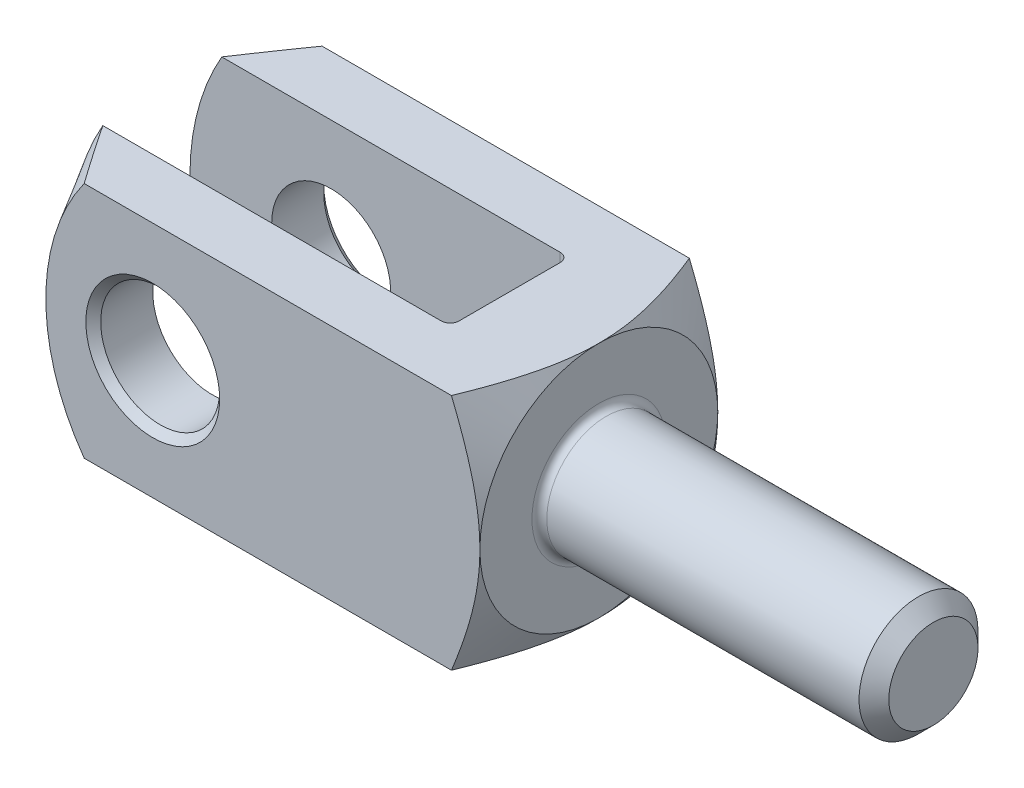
ISO-10303-21;
HEADER;
FILE_DESCRIPTION(('STEP AP214'),'2;1');
FILE_NAME('part.step','',(''),(''),'','','');
FILE_SCHEMA(('AUTOMOTIVE_DESIGN { 1 0 10303 214 1 1 1 1 }'));
ENDSEC;
DATA;
#1=APPLICATION_CONTEXT('core data for automotive mechanical design processes');
#2=APPLICATION_PROTOCOL_DEFINITION('international standard','automotive_design',2000,#1);
#3=PRODUCT_CONTEXT('',#1,'mechanical');
#4=PRODUCT('Part','Part','',(#3));
#5=PRODUCT_RELATED_PRODUCT_CATEGORY('part','',(#4));
#6=PRODUCT_DEFINITION_FORMATION('','',#4);
#7=PRODUCT_DEFINITION_CONTEXT('part definition',#1,'design');
#8=PRODUCT_DEFINITION('design','',#6,#7);
#9=PRODUCT_DEFINITION_SHAPE('','',#8);
#10=(LENGTH_UNIT() NAMED_UNIT(*) SI_UNIT(.MILLI.,.METRE.));
#11=(NAMED_UNIT(*) PLANE_ANGLE_UNIT() SI_UNIT($,.RADIAN.));
#12=(NAMED_UNIT(*) SI_UNIT($,.STERADIAN.) SOLID_ANGLE_UNIT());
#13=UNCERTAINTY_MEASURE_WITH_UNIT(LENGTH_MEASURE(1.E-05),#10,'distance_accuracy_value','');
#14=(GEOMETRIC_REPRESENTATION_CONTEXT(3) GLOBAL_UNCERTAINTY_ASSIGNED_CONTEXT((#13)) GLOBAL_UNIT_ASSIGNED_CONTEXT((#10,
#11,#12)) REPRESENTATION_CONTEXT('',''));
#15=CARTESIAN_POINT('',(0.,0.,0.));
#16=DIRECTION('',(0.,0.,1.));
#17=DIRECTION('',(1.,0.,0.));
#18=AXIS2_PLACEMENT_3D('',#15,#16,#17);
#19=CARTESIAN_POINT('',(-108.,-16.,-7.99999999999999));
#20=DIRECTION('',(0.,0.,-1.));
#21=DIRECTION('',(-1.,0.,0.));
#22=AXIS2_PLACEMENT_3D('',#19,#20,#21);
#23=PLANE('',#22);
#24=CARTESIAN_POINT('',(-89.,0.,-7.99999999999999));
#25=DIRECTION('',(0.,0.,-1.));
#26=DIRECTION('',(-1.,0.,0.));
#27=AXIS2_PLACEMENT_3D('',#24,#25,#26);
#28=CIRCLE('',#27,8.00000000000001);
#29=CARTESIAN_POINT('',(-97.,0.,-7.99999999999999));
#30=VERTEX_POINT('',#29);
#31=EDGE_CURVE('E160',#30,#30,#28,.F.);
#32=ORIENTED_EDGE('',*,*,#31,.F.);
#33=EDGE_LOOP('',(#32));
#34=FACE_BOUND('',#33,.T.);
#35=DIRECTION('',(-1.,0.,0.));
#36=VECTOR('',#35,1.);
#37=CARTESIAN_POINT('',(-108.,16.,-7.99999999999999));
#38=LINE('',#37,#36);
#39=CARTESIAN_POINT('',(-58.2,16.,-7.99999999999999));
#40=VERTEX_POINT('',#39);
#41=CARTESIAN_POINT('',(-103.712812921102,16.,-7.99999999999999));
#42=VERTEX_POINT('',#41);
#43=EDGE_CURVE('E320',#40,#42,#38,.T.);
#44=ORIENTED_EDGE('',*,*,#43,.T.);
#45=CARTESIAN_POINT('',(-76.,0.,-7.99999999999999));
#46=DIRECTION('',(0.,0.,1.));
#47=DIRECTION('',(1.,0.,0.));
#48=AXIS2_PLACEMENT_3D('',#45,#46,#47);
#49=CIRCLE('',#48,32.);
#50=CARTESIAN_POINT('',(-103.712812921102,-16.,-7.99999999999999));
#51=VERTEX_POINT('',#50);
#52=EDGE_CURVE('E61',#42,#51,#49,.T.);
#53=ORIENTED_EDGE('',*,*,#52,.T.);
#54=DIRECTION('',(-1.,0.,0.));
#55=VECTOR('',#54,1.);
#56=CARTESIAN_POINT('',(-108.,-16.,-7.99999999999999));
#57=LINE('',#56,#55);
#58=CARTESIAN_POINT('',(-58.2,-16.,-7.99999999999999));
#59=VERTEX_POINT('',#58);
#60=EDGE_CURVE('E311',#59,#51,#57,.T.);
#61=ORIENTED_EDGE('',*,*,#60,.F.);
#62=DIRECTION('',(0.,1.,0.));
#63=VECTOR('',#62,1.);
#64=CARTESIAN_POINT('',(-58.2,16.,-7.99999999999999));
#65=LINE('',#64,#63);
#66=EDGE_CURVE('E183',#59,#40,#65,.T.);
#67=ORIENTED_EDGE('',*,*,#66,.T.);
#68=EDGE_LOOP('',(#44,#53,#61,#67));
#69=FACE_BOUND('',#68,.T.);
#70=ADVANCED_FACE('F37',(#34,#69),#23,.F.);
#71=CARTESIAN_POINT('',(-108.,-16.,8.00000000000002));
#72=DIRECTION('',(0.,0.,1.));
#73=DIRECTION('',(1.,0.,0.));
#74=AXIS2_PLACEMENT_3D('',#71,#72,#73);
#75=PLANE('',#74);
#76=CARTESIAN_POINT('',(-89.,0.,8.00000000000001));
#77=DIRECTION('',(0.,0.,1.));
#78=DIRECTION('',(1.,0.,0.));
#79=AXIS2_PLACEMENT_3D('',#76,#77,#78);
#80=CIRCLE('',#79,8.00000000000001);
#81=CARTESIAN_POINT('',(-81.,0.,8.00000000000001));
#82=VERTEX_POINT('',#81);
#83=EDGE_CURVE('E164',#82,#82,#80,.F.);
#84=ORIENTED_EDGE('',*,*,#83,.F.);
#85=EDGE_LOOP('',(#84));
#86=FACE_BOUND('',#85,.T.);
#87=CARTESIAN_POINT('',(-76.,0.,8.00000000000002));
#88=DIRECTION('',(0.,0.,1.));
#89=DIRECTION('',(1.,0.,0.));
#90=AXIS2_PLACEMENT_3D('',#87,#88,#89);
#91=CIRCLE('',#90,32.);
#92=CARTESIAN_POINT('',(-103.712812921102,16.,8.00000000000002));
#93=VERTEX_POINT('',#92);
#94=CARTESIAN_POINT('',(-103.712812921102,-16.,8.00000000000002));
#95=VERTEX_POINT('',#94);
#96=EDGE_CURVE('E128',#93,#95,#91,.T.);
#97=ORIENTED_EDGE('',*,*,#96,.F.);
#98=DIRECTION('',(1.,0.,0.));
#99=VECTOR('',#98,1.);
#100=CARTESIAN_POINT('',(-108.,16.,8.00000000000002));
#101=LINE('',#100,#99);
#102=CARTESIAN_POINT('',(-58.2,16.,8.));
#103=VERTEX_POINT('',#102);
#104=EDGE_CURVE('E324',#93,#103,#101,.T.);
#105=ORIENTED_EDGE('',*,*,#104,.T.);
#106=DIRECTION('',(0.,1.,0.));
#107=VECTOR('',#106,1.);
#108=CARTESIAN_POINT('',(-58.2,-16.,8.));
#109=LINE('',#108,#107);
#110=CARTESIAN_POINT('',(-58.2,-16.,8.));
#111=VERTEX_POINT('',#110);
#112=EDGE_CURVE('E179',#103,#111,#109,.F.);
#113=ORIENTED_EDGE('',*,*,#112,.T.);
#114=DIRECTION('',(1.,0.,0.));
#115=VECTOR('',#114,1.);
#116=CARTESIAN_POINT('',(-108.,-16.,8.00000000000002));
#117=LINE('',#116,#115);
#118=EDGE_CURVE('E314',#95,#111,#117,.T.);
#119=ORIENTED_EDGE('',*,*,#118,.F.);
#120=EDGE_LOOP('',(#97,#105,#113,#119));
#121=FACE_BOUND('',#120,.T.);
#122=ADVANCED_FACE('F395',(#86,#121),#75,.F.);
#123=CARTESIAN_POINT('',(-108.,-16.,16.));
#124=DIRECTION('',(0.,0.,1.));
#125=DIRECTION('',(1.,0.,0.));
#126=AXIS2_PLACEMENT_3D('',#123,#124,#125);
#127=PLANE('',#126);
#128=CARTESIAN_POINT('',(-89.,0.,16.));
#129=DIRECTION('',(0.,0.,1.));
#130=DIRECTION('',(1.,0.,0.));
#131=AXIS2_PLACEMENT_3D('',#128,#129,#130);
#132=CIRCLE('',#131,9.00000000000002);
#133=CARTESIAN_POINT('',(-80.,0.,16.));
#134=VERTEX_POINT('',#133);
#135=EDGE_CURVE('E219',#134,#134,#132,.F.);
#136=ORIENTED_EDGE('',*,*,#135,.T.);
#137=EDGE_LOOP('',(#136));
#138=FACE_BOUND('',#137,.T.);
#139=DIRECTION('',(1.,0.,0.));
#140=VECTOR('',#139,1.);
#141=CARTESIAN_POINT('',(-108.,16.,16.));
#142=LINE('',#141,#140);
#143=CARTESIAN_POINT('',(-98.2200359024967,16.,16.));
#144=VERTEX_POINT('',#143);
#145=CARTESIAN_POINT('',(-48.8263409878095,16.,16.));
#146=VERTEX_POINT('',#145);
#147=EDGE_CURVE('E142',#144,#146,#142,.T.);
#148=ORIENTED_EDGE('',*,*,#147,.F.);
#149=CARTESIAN_POINT('',(-76.,0.,16.));
#150=DIRECTION('',(0.,0.,1.));
#151=DIRECTION('',(1.,0.,0.));
#152=AXIS2_PLACEMENT_3D('',#149,#150,#151);
#153=CIRCLE('',#152,27.381197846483);
#154=CARTESIAN_POINT('',(-98.2200359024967,-16.,16.));
#155=VERTEX_POINT('',#154);
#156=EDGE_CURVE('E53',#144,#155,#153,.T.);
#157=ORIENTED_EDGE('',*,*,#156,.T.);
#158=DIRECTION('',(1.,0.,0.));
#159=VECTOR('',#158,1.);
#160=CARTESIAN_POINT('',(-108.,-16.,16.));
#161=LINE('',#160,#159);
#162=CARTESIAN_POINT('',(-48.8263409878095,-16.,16.));
#163=VERTEX_POINT('',#162);
#164=EDGE_CURVE('E139',#155,#163,#161,.T.);
#165=ORIENTED_EDGE('',*,*,#164,.T.);
#166=CARTESIAN_POINT('',(-56.7693975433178,-32.6784696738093,16.));
#167=CARTESIAN_POINT('',(-56.5649534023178,-32.2841914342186,16.));
#168=CARTESIAN_POINT('',(-56.3610695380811,-31.8896227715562,16.));
#169=CARTESIAN_POINT('',(-55.9545422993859,-31.0998453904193,16.));
#170=CARTESIAN_POINT('',(-55.7518989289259,-30.7046366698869,16.));
#171=CARTESIAN_POINT('',(-55.1459910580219,-29.5179255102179,16.));
#172=CARTESIAN_POINT('',(-54.7447694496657,-28.725377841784,16.));
#173=CARTESIAN_POINT('',(-53.948304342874,-27.1355535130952,16.));
#174=CARTESIAN_POINT('',(-53.5530724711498,-26.3382710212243,16.));
#175=CARTESIAN_POINT('',(-52.7709229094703,-24.7396478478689,16.));
#176=CARTESIAN_POINT('',(-52.3840050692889,-23.9383072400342,16.));
#177=CARTESIAN_POINT('',(-51.5971278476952,-22.2812030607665,16.));
#178=CARTESIAN_POINT('',(-51.1978306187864,-21.4251243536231,16.));
#179=CARTESIAN_POINT('',(-50.4144189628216,-19.7059517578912,16.));
#180=CARTESIAN_POINT('',(-50.0303053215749,-18.8428575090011,16.));
#181=CARTESIAN_POINT('',(-49.469277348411,-17.5419055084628,16.));
#182=CARTESIAN_POINT('',(-49.2848287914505,-17.1072946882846,16.));
#183=CARTESIAN_POINT('',(-48.9217435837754,-16.2356552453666,16.));
#184=CARTESIAN_POINT('',(-48.7431068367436,-15.7986266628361,16.));
#185=CARTESIAN_POINT('',(-48.3925648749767,-14.9219132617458,16.));
#186=CARTESIAN_POINT('',(-48.2206591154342,-14.4822286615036,16.));
#187=CARTESIAN_POINT('',(-47.8846508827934,-13.5998952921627,16.));
#188=CARTESIAN_POINT('',(-47.7205482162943,-13.15724659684,16.));
#189=CARTESIAN_POINT('',(-47.3667959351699,-12.1723292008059,16.));
#190=CARTESIAN_POINT('',(-47.1793236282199,-11.6292738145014,16.));
#191=CARTESIAN_POINT('',(-46.8205117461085,-10.5378822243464,16.));
#192=CARTESIAN_POINT('',(-46.6491707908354,-9.98954647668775,16.));
#193=CARTESIAN_POINT('',(-46.3258019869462,-8.88718113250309,16.));
#194=CARTESIAN_POINT('',(-46.1737737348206,-8.33315165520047,16.));
#195=CARTESIAN_POINT('',(-45.892661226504,-7.21925530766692,16.));
#196=CARTESIAN_POINT('',(-45.763576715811,-6.65938850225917,16.));
#197=CARTESIAN_POINT('',(-45.5349588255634,-5.54729135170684,16.));
#198=CARTESIAN_POINT('',(-45.4348028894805,-4.99519025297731,16.));
#199=CARTESIAN_POINT('',(-45.2636126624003,-3.88645323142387,16.));
#200=CARTESIAN_POINT('',(-45.1925774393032,-3.32981745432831,16.));
#201=CARTESIAN_POINT('',(-45.0825979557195,-2.2137104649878,16.));
#202=CARTESIAN_POINT('',(-45.0436327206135,-1.65424134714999,16.));
#203=CARTESIAN_POINT('',(-44.9995121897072,-0.533966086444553,16.));
#204=CARTESIAN_POINT('',(-44.9943557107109,0.0268400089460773,16.));
#205=CARTESIAN_POINT('',(-45.0172205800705,1.106864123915,16.));
#206=CARTESIAN_POINT('',(-45.0428517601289,1.62613491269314,16.));
#207=CARTESIAN_POINT('',(-45.1223285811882,2.66248971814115,16.));
#208=CARTESIAN_POINT('',(-45.1761741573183,3.17957373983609,16.));
#209=CARTESIAN_POINT('',(-45.3101058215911,4.21056490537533,16.));
#210=CARTESIAN_POINT('',(-45.3902054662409,4.72447026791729,16.));
#211=CARTESIAN_POINT('',(-45.5740043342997,5.74801582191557,16.));
#212=CARTESIAN_POINT('',(-45.6777042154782,6.25765589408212,16.));
#213=CARTESIAN_POINT('',(-45.909120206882,7.28692593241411,16.));
#214=CARTESIAN_POINT('',(-46.0374445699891,7.80641809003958,16.));
#215=CARTESIAN_POINT('',(-46.3129308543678,8.84034891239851,16.));
#216=CARTESIAN_POINT('',(-46.4600929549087,9.35478752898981,16.));
#217=CARTESIAN_POINT('',(-46.7704071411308,10.3787720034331,16.));
#218=CARTESIAN_POINT('',(-46.9335585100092,10.8883180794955,16.));
#219=CARTESIAN_POINT('',(-47.1884088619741,11.6492037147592,16.));
#220=CARTESIAN_POINT('',(-47.2750447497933,11.9022560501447,16.));
#221=CARTESIAN_POINT('',(-47.4514227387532,12.4072754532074,16.));
#222=CARTESIAN_POINT('',(-47.5411648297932,12.6592425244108,16.));
#223=CARTESIAN_POINT('',(-47.8295171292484,13.454575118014,16.));
#224=CARTESIAN_POINT('',(-48.0333628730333,13.9960468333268,16.));
#225=CARTESIAN_POINT('',(-48.4521222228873,15.0747063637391,16.));
#226=CARTESIAN_POINT('',(-48.6670364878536,15.6118939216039,16.));
#227=CARTESIAN_POINT('',(-49.1061456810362,16.6825956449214,16.));
#228=CARTESIAN_POINT('',(-49.3303426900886,17.2161089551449,16.));
#229=CARTESIAN_POINT('',(-49.786473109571,18.2797983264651,16.));
#230=CARTESIAN_POINT('',(-50.0184063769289,18.8099744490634,16.));
#231=CARTESIAN_POINT('',(-50.4890009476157,19.8678755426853,16.));
#232=CARTESIAN_POINT('',(-50.727667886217,20.3955980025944,16.));
#233=CARTESIAN_POINT('',(-51.2105443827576,21.448499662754,16.));
#234=CARTESIAN_POINT('',(-51.4547539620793,21.9736788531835,16.));
#235=CARTESIAN_POINT('',(-51.9478700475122,23.0217502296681,16.));
#236=CARTESIAN_POINT('',(-52.1967760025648,23.5446426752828,16.));
#237=CARTESIAN_POINT('',(-52.6986473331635,24.5884772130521,16.));
#238=CARTESIAN_POINT('',(-52.9516127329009,25.1094192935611,16.));
#239=CARTESIAN_POINT('',(-53.7172875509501,26.6728451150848,16.));
#240=CARTESIAN_POINT('',(-54.2352702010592,27.7127471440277,16.));
#241=CARTESIAN_POINT('',(-55.2818275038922,29.7872182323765,16.));
#242=CARTESIAN_POINT('',(-55.8104023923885,30.8217871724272,16.));
#243=CARTESIAN_POINT('',(-56.8754784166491,32.8861860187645,16.));
#244=CARTESIAN_POINT('',(-57.4119755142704,33.916018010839,16.));
#245=CARTESIAN_POINT('',(-58.4913991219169,35.9722925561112,16.));
#246=CARTESIAN_POINT('',(-59.0343255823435,36.9987351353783,16.));
#247=CARTESIAN_POINT('',(-60.0443143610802,38.8966473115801,16.));
#248=CARTESIAN_POINT('',(-60.5106690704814,39.768493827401,16.));
#249=CARTESIAN_POINT('',(-61.446506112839,41.5105071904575,16.));
#250=CARTESIAN_POINT('',(-61.9159884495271,42.3806740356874,16.));
#251=CARTESIAN_POINT('',(-63.3285002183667,44.9892873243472,16.));
#252=CARTESIAN_POINT('',(-64.2754644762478,46.7256030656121,16.));
#253=CARTESIAN_POINT('',(-66.1715733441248,50.1841146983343,16.));
#254=CARTESIAN_POINT('',(-67.120674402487,51.9063345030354,16.));
#255=CARTESIAN_POINT('',(-68.5485244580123,54.4871624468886,16.));
#256=CARTESIAN_POINT('',(-69.0251365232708,55.346953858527,16.));
#257=CARTESIAN_POINT('',(-69.9796167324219,57.0658379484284,16.));
#258=CARTESIAN_POINT('',(-70.4574848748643,57.9249306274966,16.));
#259=CARTESIAN_POINT('',(-70.9358976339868,58.7837198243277,16.));
#260=B_SPLINE_CURVE_WITH_KNOTS('',3,(#166,#167,#168,#169,#170,#171,#172,#173,#174,#175,#176,
#177,#178,#179,#180,#181,#182,#183,#184,#185,#186,#187,#188,#189,#190,#191,#192,#193,#194,#195,
#196,#197,#198,#199,#200,#201,#202,#203,#204,#205,#206,#207,#208,#209,#210,#211,#212,#213,#214,
#215,#216,#217,#218,#219,#220,#221,#222,#223,#224,#225,#226,#227,#228,#229,#230,#231,#232,#233,
#234,#235,#236,#237,#238,#239,#240,#241,#242,#243,#244,#245,#246,#247,#248,#249,#250,#251,#252,
#253,#254,#255,#256,#257,#258,#259),.UNSPECIFIED.,.F.,.F.,(4,2,2,2,2,2,2,2,2,2,2,2,2,2,2,2,2,2,
2,2,2,2,2,2,2,2,2,2,2,2,2,2,2,2,2,2,2,2,2,2,2,2,2,2,2,2,4),(0.,1.33239347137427,
2.66479123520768,5.32972119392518,7.99929176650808,10.6688140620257,13.5025727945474,
16.3364779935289,17.7528378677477,19.1691742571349,20.5853957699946,22.0015821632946,
23.7248813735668,25.4480330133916,27.1711486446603,28.8942451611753,30.5768935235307,
32.2594880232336,33.9409811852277,35.6224155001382,37.1813298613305,38.7402406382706,
40.2999576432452,41.8597181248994,43.4646245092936,45.0695461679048,46.6743959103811,
47.4767954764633,48.2791924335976,50.0147426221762,51.7503962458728,53.4864410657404,
55.2224537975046,56.95996517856,58.6974832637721,60.4347987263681,62.172124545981,
65.6573336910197,69.1426204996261,72.6261882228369,76.1097290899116,79.0759362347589,
82.0421469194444,87.9753961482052,93.8746630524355,96.8238320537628,99.772997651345),.UNSPECIFIED.);
#261=CARTESIAN_POINT('',(-45.,0.,16.));
#262=VERTEX_POINT('',#261);
#263=EDGE_CURVE('E283',#262,#163,#260,.F.);
#264=ORIENTED_EDGE('',*,*,#263,.F.);
#265=EDGE_CURVE('E281',#146,#262,#260,.F.);
#266=ORIENTED_EDGE('',*,*,#265,.F.);
#267=EDGE_LOOP('',(#148,#157,#165,#264,#266));
#268=FACE_BOUND('',#267,.T.);
#269=ADVANCED_FACE('F137',(#138,#268),#127,.T.);
#270=CARTESIAN_POINT('',(-108.,-16.,16.));
#271=DIRECTION('',(0.,-1.,0.));
#272=DIRECTION('',(0.,0.,-1.));
#273=AXIS2_PLACEMENT_3D('',#270,#271,#272);
#274=PLANE('',#273);
#275=ORIENTED_EDGE('',*,*,#60,.T.);
#276=CARTESIAN_POINT('',(-116.37142925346,-16.,11.7911070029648));
#277=CARTESIAN_POINT('',(-115.592945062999,-16.,10.5376757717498));
#278=CARTESIAN_POINT('',(-114.81232808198,-16.,9.28556385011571));
#279=CARTESIAN_POINT('',(-113.245832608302,-16.,6.78460141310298));
#280=CARTESIAN_POINT('',(-112.459954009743,-16.,5.53575096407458));
#281=CARTESIAN_POINT('',(-110.881028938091,-16.,3.04049656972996));
#282=CARTESIAN_POINT('',(-110.087975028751,-16.,1.7940973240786));
#283=CARTESIAN_POINT('',(-108.892706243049,-16.,-0.0718476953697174));
#284=CARTESIAN_POINT('',(-108.493337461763,-16.,-0.693217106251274));
#285=CARTESIAN_POINT('',(-107.692490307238,-16.,-1.93460096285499));
#286=CARTESIAN_POINT('',(-107.291011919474,-16.,-2.55461539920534));
#287=CARTESIAN_POINT('',(-106.049557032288,-16.,-4.46394316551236));
#288=CARTESIAN_POINT('',(-105.205685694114,-16.,-5.7507287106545));
#289=CARTESIAN_POINT('',(-103.505216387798,-16.,-8.31586424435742));
#290=CARTESIAN_POINT('',(-102.64861856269,-16.,-9.59421432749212));
#291=CARTESIAN_POINT('',(-101.351696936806,-16.,-11.5028868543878));
#292=CARTESIAN_POINT('',(-100.917546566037,-16.,-12.1374051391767));
#293=CARTESIAN_POINT('',(-100.04451814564,-16.,-13.4031790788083));
#294=CARTESIAN_POINT('',(-99.6056401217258,-16.,-14.0344347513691));
#295=CARTESIAN_POINT('',(-98.7224503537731,-16.,-15.2930972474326));
#296=CARTESIAN_POINT('',(-98.2781388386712,-16.,-15.9205042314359));
#297=CARTESIAN_POINT('',(-97.3831787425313,-16.,-17.1707775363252));
#298=CARTESIAN_POINT('',(-96.9325302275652,-16.,-17.7936439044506));
#299=CARTESIAN_POINT('',(-96.0280293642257,-16.,-19.0281553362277));
#300=CARTESIAN_POINT('',(-95.5742460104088,-16.,-19.6398508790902));
#301=CARTESIAN_POINT('',(-94.6580392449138,-16.,-20.856766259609));
#302=CARTESIAN_POINT('',(-94.1956156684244,-16.,-21.4619859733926));
#303=CARTESIAN_POINT('',(-93.2598142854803,-16.,-22.66525143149));
#304=CARTESIAN_POINT('',(-92.7864223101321,-16.,-23.2632861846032));
#305=CARTESIAN_POINT('',(-91.8271654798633,-16.,-24.4492371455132));
#306=CARTESIAN_POINT('',(-91.3413013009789,-16.,-25.0371538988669));
#307=CARTESIAN_POINT('',(-90.3593848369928,-16.,-26.1940459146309));
#308=CARTESIAN_POINT('',(-89.8634904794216,-16.,-26.7631543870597));
#309=CARTESIAN_POINT('',(-89.105661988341,-16.,-27.6043633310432));
#310=CARTESIAN_POINT('',(-88.8506801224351,-16.,-27.8827334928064));
#311=CARTESIAN_POINT('',(-88.3355101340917,-16.,-28.4346076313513));
#312=CARTESIAN_POINT('',(-88.0753221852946,-16.,-28.7081117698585));
#313=CARTESIAN_POINT('',(-87.5496746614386,-16.,-29.2488627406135));
#314=CARTESIAN_POINT('',(-87.2842277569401,-16.,-29.516121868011));
#315=CARTESIAN_POINT('',(-86.7468052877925,-16.,-30.0439769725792));
#316=CARTESIAN_POINT('',(-86.4748301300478,-16.,-30.3045733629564));
#317=CARTESIAN_POINT('',(-85.9236476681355,-16.,-30.8177372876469));
#318=CARTESIAN_POINT('',(-85.6444440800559,-16.,-31.0703088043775));
#319=CARTESIAN_POINT('',(-85.0777664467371,-16.,-31.5659640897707));
#320=CARTESIAN_POINT('',(-84.7902936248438,-16.,-31.8090492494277));
#321=CARTESIAN_POINT('',(-84.3468920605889,-16.,-32.1692925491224));
#322=CARTESIAN_POINT('',(-84.1943717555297,-16.,-32.290653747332));
#323=CARTESIAN_POINT('',(-83.8866765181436,-16.,-32.5299575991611));
#324=CARTESIAN_POINT('',(-83.7315016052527,-16.,-32.6479002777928));
#325=CARTESIAN_POINT('',(-83.2616904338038,-16.,-32.9961048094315));
#326=CARTESIAN_POINT('',(-82.9428096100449,-16.,-33.2207088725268));
#327=CARTESIAN_POINT('',(-82.2928256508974,-16.,-33.6509952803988));
#328=CARTESIAN_POINT('',(-81.9617323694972,-16.,-33.8566924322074));
#329=CARTESIAN_POINT('',(-81.2860892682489,-16.,-34.2447467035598));
#330=CARTESIAN_POINT('',(-80.9415429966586,-16.,-34.4271099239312));
#331=CARTESIAN_POINT('',(-80.3187542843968,-16.,-34.7245627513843));
#332=CARTESIAN_POINT('',(-80.0433165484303,-16.,-34.8455088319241));
#333=CARTESIAN_POINT('',(-79.4844448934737,-16.,-35.0671656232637));
#334=CARTESIAN_POINT('',(-79.2010136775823,-16.,-35.1678830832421));
#335=CARTESIAN_POINT('',(-78.6272287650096,-16.,-35.3459456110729));
#336=CARTESIAN_POINT('',(-78.3368843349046,-16.,-35.4233202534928));
#337=CARTESIAN_POINT('',(-77.7504269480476,-16.,-35.5520122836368));
#338=CARTESIAN_POINT('',(-77.4543142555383,-16.,-35.6033308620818));
#339=CARTESIAN_POINT('',(-76.8555360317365,-16.,-35.6780890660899));
#340=CARTESIAN_POINT('',(-76.5528345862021,-16.,-35.7012449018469));
#341=CARTESIAN_POINT('',(-75.9466256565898,-16.,-35.7176301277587));
#342=CARTESIAN_POINT('',(-75.6431182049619,-16.,-35.7108607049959));
#343=CARTESIAN_POINT('',(-75.0381777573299,-16.,-35.6677225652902));
#344=CARTESIAN_POINT('',(-74.736745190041,-16.,-35.6313479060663));
#345=CARTESIAN_POINT('',(-74.1385996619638,-16.,-35.530673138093));
#346=CARTESIAN_POINT('',(-73.841887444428,-16.,-35.4663686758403));
#347=CARTESIAN_POINT('',(-73.2008177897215,-16.,-35.2982030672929));
#348=CARTESIAN_POINT('',(-72.8578103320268,-16.,-35.1892223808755));
#349=CARTESIAN_POINT('',(-72.1829198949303,-16.,-34.940831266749));
#350=CARTESIAN_POINT('',(-71.8510432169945,-16.,-34.8014039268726));
#351=CARTESIAN_POINT('',(-71.3616955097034,-16.,-34.5731174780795));
#352=CARTESIAN_POINT('',(-71.1997313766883,-16.,-34.4936845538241));
#353=CARTESIAN_POINT('',(-70.8788299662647,-16.,-34.3290841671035));
#354=CARTESIAN_POINT('',(-70.7198913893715,-16.,-34.2439192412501));
#355=CARTESIAN_POINT('',(-70.2474402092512,-16.,-33.980610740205));
#356=CARTESIAN_POINT('',(-69.9382745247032,-16.,-33.7946450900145));
#357=CARTESIAN_POINT('',(-69.231274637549,-16.,-33.3419896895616));
#358=CARTESIAN_POINT('',(-68.8376126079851,-16.,-33.0688272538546));
#359=CARTESIAN_POINT('',(-68.0671777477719,-16.,-32.4995062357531));
#360=CARTESIAN_POINT('',(-67.6904130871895,-16.,-32.2033367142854));
#361=CARTESIAN_POINT('',(-66.9509392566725,-16.,-31.5926380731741));
#362=CARTESIAN_POINT('',(-66.5882585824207,-16.,-31.2780746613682));
#363=CARTESIAN_POINT('',(-65.8756929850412,-16.,-30.6349635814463));
#364=CARTESIAN_POINT('',(-65.5258059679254,-16.,-30.3064182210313));
#365=CARTESIAN_POINT('',(-64.8346538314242,-16.,-29.6358722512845));
#366=CARTESIAN_POINT('',(-64.4934620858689,-16.,-29.2937963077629));
#367=CARTESIAN_POINT('',(-63.8205894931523,-16.,-28.6004219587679));
#368=CARTESIAN_POINT('',(-63.488908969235,-16.,-28.2491232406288));
#369=CARTESIAN_POINT('',(-62.8341115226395,-16.,-27.5393264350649));
#370=CARTESIAN_POINT('',(-62.5109860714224,-16.,-27.1808361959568));
#371=CARTESIAN_POINT('',(-61.8718712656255,-16.,-26.4575770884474));
#372=CARTESIAN_POINT('',(-61.5558817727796,-16.,-26.0928083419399));
#373=CARTESIAN_POINT('',(-60.8004695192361,-16.,-25.2057450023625));
#374=CARTESIAN_POINT('',(-60.3641536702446,-16.,-24.6808057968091));
#375=CARTESIAN_POINT('',(-59.5017899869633,-16.,-23.6224177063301));
#376=CARTESIAN_POINT('',(-59.0757441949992,-16.,-23.0889671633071));
#377=CARTESIAN_POINT('',(-58.2388292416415,-16.,-22.0234541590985));
#378=CARTESIAN_POINT('',(-57.8278275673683,-16.,-21.4914956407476));
#379=CARTESIAN_POINT('',(-57.2167920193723,-16.,-20.6895302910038));
#380=CARTESIAN_POINT('',(-57.0140541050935,-16.,-20.4215769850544));
#381=CARTESIAN_POINT('',(-56.6102515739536,-16.,-19.8844163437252));
#382=CARTESIAN_POINT('',(-56.4091869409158,-16.,-19.6152090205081));
#383=CARTESIAN_POINT('',(-56.208892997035,-16.,-19.3454290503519));
#384=B_SPLINE_CURVE_WITH_KNOTS('',3,(#276,#277,#278,#279,#280,#281,#282,#283,#284,#285,#286,
#287,#288,#289,#290,#291,#292,#293,#294,#295,#296,#297,#298,#299,#300,#301,#302,#303,#304,#305,
#306,#307,#308,#309,#310,#311,#312,#313,#314,#315,#316,#317,#318,#319,#320,#321,#322,#323,#324,
#325,#326,#327,#328,#329,#330,#331,#332,#333,#334,#335,#336,#337,#338,#339,#340,#341,#342,#343,
#344,#345,#346,#347,#348,#349,#350,#351,#352,#353,#354,#355,#356,#357,#358,#359,#360,#361,#362,
#363,#364,#365,#366,#367,#368,#369,#370,#371,#372,#373,#374,#375,#376,#377,#378,#379,#380,#381,
#382,#383),.UNSPECIFIED.,.F.,.F.,(4,2,2,2,2,2,2,2,2,2,2,2,2,2,2,2,2,2,2,2,2,2,2,2,2,2,2,2,2,2,2,
2,2,2,2,2,2,2,2,2,2,2,2,2,2,2,2,2,2,2,2,2,2,4),(0.,4.42653200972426,8.85315338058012,
13.2850586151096,15.5009877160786,17.71693209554,22.3333045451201,26.9496251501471,
29.256098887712,31.5625600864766,33.8689244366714,36.1752647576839,38.4601118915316,
40.745002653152,43.033030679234,45.3209349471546,47.5851104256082,48.7175544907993,
49.8499608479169,50.979908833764,52.1097865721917,53.2390945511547,54.3682363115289,
54.9529313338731,55.5376220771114,56.7071657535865,57.8757855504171,59.0440991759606,
59.9458947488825,60.847388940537,61.7477361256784,62.6480421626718,63.5573471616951,
64.466616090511,65.3760675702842,66.2856608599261,67.363665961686,68.4422713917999,
68.9833574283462,69.5242055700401,70.6058434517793,72.0422032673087,73.4792502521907,
74.9190675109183,76.3586480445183,77.8078630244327,79.2571271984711,80.7048876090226,
82.1526199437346,84.2002258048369,86.2482355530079,88.2648689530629,89.272888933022,
90.2808991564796),.UNSPECIFIED.);
#385=CARTESIAN_POINT('',(-98.2200359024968,-16.,-16.));
#386=VERTEX_POINT('',#385);
#387=EDGE_CURVE('E133',#51,#386,#384,.T.);
#388=ORIENTED_EDGE('',*,*,#387,.T.);
#389=DIRECTION('',(1.,0.,0.));
#390=VECTOR('',#389,1.);
#391=CARTESIAN_POINT('',(-108.,-16.,-16.));
#392=LINE('',#391,#390);
#393=CARTESIAN_POINT('',(-48.8263409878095,-16.,-16.));
#394=VERTEX_POINT('',#393);
#395=EDGE_CURVE('E152',#386,#394,#392,.T.);
#396=ORIENTED_EDGE('',*,*,#395,.T.);
#397=CARTESIAN_POINT('',(-56.7693975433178,-16.,-32.6784696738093));
#398=CARTESIAN_POINT('',(-56.5649534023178,-16.,-32.2841914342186));
#399=CARTESIAN_POINT('',(-56.3610695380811,-16.,-31.8896227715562));
#400=CARTESIAN_POINT('',(-55.9545422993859,-16.,-31.0998453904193));
#401=CARTESIAN_POINT('',(-55.7518989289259,-16.,-30.7046366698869));
#402=CARTESIAN_POINT('',(-55.1459910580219,-16.,-29.5179255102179));
#403=CARTESIAN_POINT('',(-54.7447694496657,-16.,-28.725377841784));
#404=CARTESIAN_POINT('',(-53.948304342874,-16.,-27.1355535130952));
#405=CARTESIAN_POINT('',(-53.5530724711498,-16.,-26.3382710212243));
#406=CARTESIAN_POINT('',(-52.7709229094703,-16.,-24.7396478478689));
#407=CARTESIAN_POINT('',(-52.3840050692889,-16.,-23.9383072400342));
#408=CARTESIAN_POINT('',(-51.5971278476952,-16.,-22.2812030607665));
#409=CARTESIAN_POINT('',(-51.1978306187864,-16.,-21.4251243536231));
#410=CARTESIAN_POINT('',(-50.4144189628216,-16.,-19.7059517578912));
#411=CARTESIAN_POINT('',(-50.0303053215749,-16.,-18.8428575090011));
#412=CARTESIAN_POINT('',(-49.469277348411,-16.,-17.5419055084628));
#413=CARTESIAN_POINT('',(-49.2848287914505,-16.,-17.1072946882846));
#414=CARTESIAN_POINT('',(-48.9217435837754,-16.,-16.2356552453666));
#415=CARTESIAN_POINT('',(-48.7431068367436,-16.,-15.7986266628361));
#416=CARTESIAN_POINT('',(-48.3925648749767,-16.,-14.9219132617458));
#417=CARTESIAN_POINT('',(-48.2206591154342,-16.,-14.4822286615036));
#418=CARTESIAN_POINT('',(-47.8846508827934,-16.,-13.5998952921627));
#419=CARTESIAN_POINT('',(-47.7205482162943,-16.,-13.15724659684));
#420=CARTESIAN_POINT('',(-47.3667959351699,-16.,-12.1723292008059));
#421=CARTESIAN_POINT('',(-47.1793236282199,-16.,-11.6292738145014));
#422=CARTESIAN_POINT('',(-46.8205117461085,-16.,-10.5378822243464));
#423=CARTESIAN_POINT('',(-46.6491707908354,-16.,-9.98954647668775));
#424=CARTESIAN_POINT('',(-46.3258019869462,-16.,-8.88718113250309));
#425=CARTESIAN_POINT('',(-46.1737737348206,-16.,-8.33315165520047));
#426=CARTESIAN_POINT('',(-45.892661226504,-16.,-7.21925530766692));
#427=CARTESIAN_POINT('',(-45.763576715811,-16.,-6.65938850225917));
#428=CARTESIAN_POINT('',(-45.5349588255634,-16.,-5.54729135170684));
#429=CARTESIAN_POINT('',(-45.4348028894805,-16.,-4.99519025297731));
#430=CARTESIAN_POINT('',(-45.2636126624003,-16.,-3.88645323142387));
#431=CARTESIAN_POINT('',(-45.1925774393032,-16.,-3.32981745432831));
#432=CARTESIAN_POINT('',(-45.0825979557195,-16.,-2.2137104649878));
#433=CARTESIAN_POINT('',(-45.0436327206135,-16.,-1.65424134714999));
#434=CARTESIAN_POINT('',(-44.9995121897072,-16.,-0.533966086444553));
#435=CARTESIAN_POINT('',(-44.9943557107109,-16.,0.0268400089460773));
#436=CARTESIAN_POINT('',(-45.0172205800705,-16.,1.106864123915));
#437=CARTESIAN_POINT('',(-45.0428517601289,-16.,1.62613491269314));
#438=CARTESIAN_POINT('',(-45.1223285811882,-16.,2.66248971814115));
#439=CARTESIAN_POINT('',(-45.1761741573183,-16.,3.17957373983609));
#440=CARTESIAN_POINT('',(-45.3101058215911,-16.,4.21056490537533));
#441=CARTESIAN_POINT('',(-45.3902054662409,-16.,4.72447026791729));
#442=CARTESIAN_POINT('',(-45.5740043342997,-16.,5.74801582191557));
#443=CARTESIAN_POINT('',(-45.6777042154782,-16.,6.25765589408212));
#444=CARTESIAN_POINT('',(-45.909120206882,-16.,7.28692593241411));
#445=CARTESIAN_POINT('',(-46.0374445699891,-16.,7.80641809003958));
#446=CARTESIAN_POINT('',(-46.3129308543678,-16.,8.84034891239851));
#447=CARTESIAN_POINT('',(-46.4600929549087,-16.,9.35478752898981));
#448=CARTESIAN_POINT('',(-46.7704071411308,-16.,10.3787720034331));
#449=CARTESIAN_POINT('',(-46.9335585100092,-16.,10.8883180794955));
#450=CARTESIAN_POINT('',(-47.1884088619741,-16.,11.6492037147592));
#451=CARTESIAN_POINT('',(-47.2750447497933,-16.,11.9022560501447));
#452=CARTESIAN_POINT('',(-47.4514227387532,-16.,12.4072754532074));
#453=CARTESIAN_POINT('',(-47.5411648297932,-16.,12.6592425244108));
#454=CARTESIAN_POINT('',(-47.8295171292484,-16.,13.454575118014));
#455=CARTESIAN_POINT('',(-48.0333628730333,-16.,13.9960468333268));
#456=CARTESIAN_POINT('',(-48.4521222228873,-16.,15.0747063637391));
#457=CARTESIAN_POINT('',(-48.6670364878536,-16.,15.6118939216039));
#458=CARTESIAN_POINT('',(-49.1061456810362,-16.,16.6825956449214));
#459=CARTESIAN_POINT('',(-49.3303426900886,-16.,17.2161089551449));
#460=CARTESIAN_POINT('',(-49.786473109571,-16.,18.2797983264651));
#461=CARTESIAN_POINT('',(-50.0184063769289,-16.,18.8099744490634));
#462=CARTESIAN_POINT('',(-50.4890009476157,-16.,19.8678755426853));
#463=CARTESIAN_POINT('',(-50.727667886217,-16.,20.3955980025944));
#464=CARTESIAN_POINT('',(-51.2105443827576,-16.,21.448499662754));
#465=CARTESIAN_POINT('',(-51.4547539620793,-16.,21.9736788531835));
#466=CARTESIAN_POINT('',(-51.9478700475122,-16.,23.0217502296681));
#467=CARTESIAN_POINT('',(-52.1967760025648,-16.,23.5446426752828));
#468=CARTESIAN_POINT('',(-52.6986473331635,-16.,24.5884772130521));
#469=CARTESIAN_POINT('',(-52.9516127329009,-16.,25.1094192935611));
#470=CARTESIAN_POINT('',(-53.7172875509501,-16.,26.6728451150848));
#471=CARTESIAN_POINT('',(-54.2352702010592,-16.,27.7127471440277));
#472=CARTESIAN_POINT('',(-55.2818275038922,-16.,29.7872182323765));
#473=CARTESIAN_POINT('',(-55.8104023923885,-16.,30.8217871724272));
#474=CARTESIAN_POINT('',(-56.8754784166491,-16.,32.8861860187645));
#475=CARTESIAN_POINT('',(-57.4119755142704,-16.,33.916018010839));
#476=CARTESIAN_POINT('',(-58.4913991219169,-16.,35.9722925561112));
#477=CARTESIAN_POINT('',(-59.0343255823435,-16.,36.9987351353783));
#478=CARTESIAN_POINT('',(-60.0443143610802,-16.,38.8966473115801));
#479=CARTESIAN_POINT('',(-60.5106690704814,-16.,39.768493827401));
#480=CARTESIAN_POINT('',(-61.446506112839,-16.,41.5105071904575));
#481=CARTESIAN_POINT('',(-61.9159884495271,-16.,42.3806740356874));
#482=CARTESIAN_POINT('',(-63.3285002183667,-16.,44.9892873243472));
#483=CARTESIAN_POINT('',(-64.2754644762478,-16.,46.7256030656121));
#484=CARTESIAN_POINT('',(-66.1715733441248,-16.,50.1841146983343));
#485=CARTESIAN_POINT('',(-67.120674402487,-16.,51.9063345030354));
#486=CARTESIAN_POINT('',(-68.5485244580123,-16.,54.4871624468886));
#487=CARTESIAN_POINT('',(-69.0251365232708,-16.,55.346953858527));
#488=CARTESIAN_POINT('',(-69.9796167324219,-16.,57.0658379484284));
#489=CARTESIAN_POINT('',(-70.4574848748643,-16.,57.9249306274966));
#490=CARTESIAN_POINT('',(-70.9358976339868,-16.,58.7837198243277));
#491=B_SPLINE_CURVE_WITH_KNOTS('',3,(#397,#398,#399,#400,#401,#402,#403,#404,#405,#406,#407,
#408,#409,#410,#411,#412,#413,#414,#415,#416,#417,#418,#419,#420,#421,#422,#423,#424,#425,#426,
#427,#428,#429,#430,#431,#432,#433,#434,#435,#436,#437,#438,#439,#440,#441,#442,#443,#444,#445,
#446,#447,#448,#449,#450,#451,#452,#453,#454,#455,#456,#457,#458,#459,#460,#461,#462,#463,#464,
#465,#466,#467,#468,#469,#470,#471,#472,#473,#474,#475,#476,#477,#478,#479,#480,#481,#482,#483,
#484,#485,#486,#487,#488,#489,#490),.UNSPECIFIED.,.F.,.F.,(4,2,2,2,2,2,2,2,2,2,2,2,2,2,2,2,2,2,
2,2,2,2,2,2,2,2,2,2,2,2,2,2,2,2,2,2,2,2,2,2,2,2,2,2,2,2,4),(0.,1.33239347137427,
2.66479123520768,5.32972119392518,7.99929176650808,10.6688140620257,13.5025727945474,
16.3364779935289,17.7528378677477,19.1691742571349,20.5853957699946,22.0015821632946,
23.7248813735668,25.4480330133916,27.1711486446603,28.8942451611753,30.5768935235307,
32.2594880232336,33.9409811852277,35.6224155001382,37.1813298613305,38.7402406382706,
40.2999576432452,41.8597181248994,43.4646245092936,45.0695461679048,46.6743959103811,
47.4767954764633,48.2791924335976,50.0147426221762,51.7503962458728,53.4864410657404,
55.2224537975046,56.95996517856,58.6974832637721,60.4347987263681,62.172124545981,
65.6573336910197,69.1426204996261,72.6261882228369,76.1097290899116,79.0759362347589,
82.0421469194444,87.9753961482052,93.8746630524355,96.8238320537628,99.772997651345),.UNSPECIFIED.);
#492=CARTESIAN_POINT('',(-45.,-16.,0.));
#493=VERTEX_POINT('',#492);
#494=EDGE_CURVE('E282',#493,#394,#491,.F.);
#495=ORIENTED_EDGE('',*,*,#494,.F.);
#496=EDGE_CURVE('E150',#163,#493,#491,.F.);
#497=ORIENTED_EDGE('',*,*,#496,.F.);
#498=ORIENTED_EDGE('',*,*,#164,.F.);
#499=CARTESIAN_POINT('',(-56.208892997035,-16.,19.3454290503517));
#500=CARTESIAN_POINT('',(-56.5343280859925,-16.,19.783727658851));
#501=CARTESIAN_POINT('',(-56.861774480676,-16.,20.2205443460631));
#502=CARTESIAN_POINT('',(-57.5213241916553,-16.,21.0906945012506));
#503=CARTESIAN_POINT('',(-57.8534278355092,-16.,21.5240277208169));
#504=CARTESIAN_POINT('',(-58.5234742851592,-16.,22.3873945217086));
#505=CARTESIAN_POINT('',(-58.8614264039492,-16.,22.8174208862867));
#506=CARTESIAN_POINT('',(-59.5433503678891,-16.,23.6726643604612));
#507=CARTESIAN_POINT('',(-59.8873220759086,-16.,24.097881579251));
#508=CARTESIAN_POINT('',(-60.5856230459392,-16.,24.9467794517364));
#509=CARTESIAN_POINT('',(-60.9400209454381,-16.,25.3704037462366));
#510=CARTESIAN_POINT('',(-61.6570169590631,-16.,26.2106510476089));
#511=CARTESIAN_POINT('',(-62.0196148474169,-16.,26.6272742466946));
#512=CARTESIAN_POINT('',(-62.7541639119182,-16.,27.4517205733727));
#513=CARTESIAN_POINT('',(-63.1261087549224,-16.,27.8595493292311));
#514=CARTESIAN_POINT('',(-63.8812430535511,-16.,28.6646279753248));
#515=CARTESIAN_POINT('',(-64.2644313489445,-16.,29.0618789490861));
#516=CARTESIAN_POINT('',(-64.9826357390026,-16.,29.7814301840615));
#517=CARTESIAN_POINT('',(-65.3157096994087,-16.,30.1056644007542));
#518=CARTESIAN_POINT('',(-65.9928788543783,-16.,30.742530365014));
#519=CARTESIAN_POINT('',(-66.3369750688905,-16.,31.0551610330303));
#520=CARTESIAN_POINT('',(-67.0381059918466,-16.,31.666044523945));
#521=CARTESIAN_POINT('',(-67.3951479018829,-16.,31.9642891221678));
#522=CARTESIAN_POINT('',(-68.1239564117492,-16.,32.5422774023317));
#523=CARTESIAN_POINT('',(-68.4957212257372,-16.,32.8220233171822));
#524=CARTESIAN_POINT('',(-69.2025841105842,-16.,33.320018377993));
#525=CARTESIAN_POINT('',(-69.5354771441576,-16.,33.5413810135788));
#526=CARTESIAN_POINT('',(-70.215045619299,-16.,33.9621741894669));
#527=CARTESIAN_POINT('',(-70.561723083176,-16.,34.1616014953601));
#528=CARTESIAN_POINT('',(-71.2685014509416,-16.,34.5323377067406));
#529=CARTESIAN_POINT('',(-71.6285550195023,-16.,34.7037359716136));
#530=CARTESIAN_POINT('',(-72.362971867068,-16.,35.0125270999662));
#531=CARTESIAN_POINT('',(-72.7373261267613,-16.,35.1499410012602));
#532=CARTESIAN_POINT('',(-73.3786481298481,-16.,35.3468644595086));
#533=CARTESIAN_POINT('',(-73.6422795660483,-16.,35.4172777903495));
#534=CARTESIAN_POINT('',(-74.1743634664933,-16.,35.5367340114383));
#535=CARTESIAN_POINT('',(-74.4428152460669,-16.,35.5857799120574));
#536=CARTESIAN_POINT('',(-74.9827817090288,-16.,35.6607718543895));
#537=CARTESIAN_POINT('',(-75.254294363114,-16.,35.6867323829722));
#538=CARTESIAN_POINT('',(-75.7985682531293,-16.,35.7146211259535));
#539=CARTESIAN_POINT('',(-76.071329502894,-16.,35.7165490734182));
#540=CARTESIAN_POINT('',(-76.6160729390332,-16.,35.6962902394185));
#541=CARTESIAN_POINT('',(-76.8880547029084,-16.,35.6740922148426));
#542=CARTESIAN_POINT('',(-77.4290774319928,-16.,35.606418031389));
#543=CARTESIAN_POINT('',(-77.6981183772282,-16.,35.5609417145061));
#544=CARTESIAN_POINT('',(-78.2317162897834,-16.,35.4482935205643));
#545=CARTESIAN_POINT('',(-78.4962710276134,-16.,35.3811111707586));
#546=CARTESIAN_POINT('',(-79.0195871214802,-16.,35.2271491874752));
#547=CARTESIAN_POINT('',(-79.2783476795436,-16.,35.1403668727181));
#548=CARTESIAN_POINT('',(-79.933876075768,-16.,34.8954920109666));
#549=CARTESIAN_POINT('',(-80.3259608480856,-16.,34.7248216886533));
#550=CARTESIAN_POINT('',(-81.0934806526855,-16.,34.3494654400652));
#551=CARTESIAN_POINT('',(-81.4689041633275,-16.,34.1447564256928));
#552=CARTESIAN_POINT('',(-82.2052800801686,-16.,33.7076840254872));
#553=CARTESIAN_POINT('',(-82.5661659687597,-16.,33.4752094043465));
#554=CARTESIAN_POINT('',(-83.0963599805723,-16.,33.1106749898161));
#555=CARTESIAN_POINT('',(-83.2712111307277,-16.,32.9865454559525));
#556=CARTESIAN_POINT('',(-83.6174575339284,-16.,32.7335573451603));
#557=CARTESIAN_POINT('',(-83.7888528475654,-16.,32.6046988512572));
#558=CARTESIAN_POINT('',(-84.302174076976,-16.,32.2087380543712));
#559=CARTESIAN_POINT('',(-84.6390918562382,-16.,31.9351296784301));
#560=CARTESIAN_POINT('',(-85.3013469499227,-16.,31.3741828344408));
#561=CARTESIAN_POINT('',(-85.6266813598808,-16.,31.0868409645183));
#562=CARTESIAN_POINT('',(-86.2675032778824,-16.,30.5008240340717));
#563=CARTESIAN_POINT('',(-86.5829813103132,-16.,30.2021386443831));
#564=CARTESIAN_POINT('',(-87.2050534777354,-16.,29.59573594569));
#565=CARTESIAN_POINT('',(-87.5116483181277,-16.,29.2880193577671));
#566=CARTESIAN_POINT('',(-88.1181817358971,-16.,28.6639826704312));
#567=CARTESIAN_POINT('',(-88.418092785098,-16.,28.3476358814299));
#568=CARTESIAN_POINT('',(-89.0110985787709,-16.,27.708620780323));
#569=CARTESIAN_POINT('',(-89.3041932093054,-16.,27.3859523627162));
#570=CARTESIAN_POINT('',(-89.8842425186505,-16.,26.7354353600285));
#571=CARTESIAN_POINT('',(-90.1712001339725,-16.,26.4075893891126));
#572=CARTESIAN_POINT('',(-90.7398217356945,-16.,25.7473333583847));
#573=CARTESIAN_POINT('',(-91.0214855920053,-16.,25.4149231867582));
#574=CARTESIAN_POINT('',(-91.8663667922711,-16.,24.4035532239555));
#575=CARTESIAN_POINT('',(-92.4223317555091,-16.,23.7185297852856));
#576=CARTESIAN_POINT('',(-93.5190448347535,-16.,22.3363659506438));
#577=CARTESIAN_POINT('',(-94.0597914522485,-16.,21.6392243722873));
#578=CARTESIAN_POINT('',(-95.1277612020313,-16.,20.2370767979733));
#579=CARTESIAN_POINT('',(-95.6550112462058,-16.,19.5320912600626));
#580=CARTESIAN_POINT('',(-96.6994194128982,-16.,18.1146749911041));
#581=CARTESIAN_POINT('',(-97.2165773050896,-16.,17.4022440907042));
#582=CARTESIAN_POINT('',(-98.1512877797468,-16.,16.0985587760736));
#583=CARTESIAN_POINT('',(-98.5702025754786,-16.,15.5082792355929));
#584=CARTESIAN_POINT('',(-99.4030978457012,-16.,14.324247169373));
#585=CARTESIAN_POINT('',(-99.8170782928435,-16.,13.730494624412));
#586=CARTESIAN_POINT('',(-101.052609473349,-16.,11.9447582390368));
#587=CARTESIAN_POINT('',(-101.867729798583,-16.,10.7483240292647));
#588=CARTESIAN_POINT('',(-103.485413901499,-16.,8.34545074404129));
#589=CARTESIAN_POINT('',(-104.287965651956,-16.,7.13900359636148));
#590=CARTESIAN_POINT('',(-105.882510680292,-16.,4.71914851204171));
#591=CARTESIAN_POINT('',(-106.674503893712,-16.,3.50574053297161));
#592=CARTESIAN_POINT('',(-108.21757047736,-16.,1.1234248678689));
#593=CARTESIAN_POINT('',(-108.968987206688,-16.,-0.0452607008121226));
#594=CARTESIAN_POINT('',(-110.465347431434,-16.,-2.38677525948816));
#595=CARTESIAN_POINT('',(-111.210290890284,-16.,-3.55960427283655));
#596=CARTESIAN_POINT('',(-112.693877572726,-16.,-5.90725849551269));
#597=CARTESIAN_POINT('',(-113.432527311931,-16.,-7.08207959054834));
#598=CARTESIAN_POINT('',(-114.905225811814,-16.,-9.43457885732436));
#599=CARTESIAN_POINT('',(-115.63927463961,-16.,-10.6122569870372));
#600=CARTESIAN_POINT('',(-116.371429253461,-16.,-11.7911070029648));
#601=B_SPLINE_CURVE_WITH_KNOTS('',3,(#499,#500,#501,#502,#503,#504,#505,#506,#507,#508,#509,
#510,#511,#512,#513,#514,#515,#516,#517,#518,#519,#520,#521,#522,#523,#524,#525,#526,#527,#528,
#529,#530,#531,#532,#533,#534,#535,#536,#537,#538,#539,#540,#541,#542,#543,#544,#545,#546,#547,
#548,#549,#550,#551,#552,#553,#554,#555,#556,#557,#558,#559,#560,#561,#562,#563,#564,#565,#566,
#567,#568,#569,#570,#571,#572,#573,#574,#575,#576,#577,#578,#579,#580,#581,#582,#583,#584,#585,
#586,#587,#588,#589,#590,#591,#592,#593,#594,#595,#596,#597,#598,#599,#600),.UNSPECIFIED.,.F.,
.F.,(4,2,2,2,2,2,2,2,2,2,2,2,2,2,2,2,2,2,2,2,2,2,2,2,2,2,2,2,2,2,2,2,2,2,2,2,2,2,2,2,2,2,2,2,2,
2,2,2,2,2,4),(0.,1.63772680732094,3.27556938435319,4.91631731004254,6.55702790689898,
8.21389427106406,9.87071507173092,11.5264420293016,13.1819987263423,14.5762631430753,
15.9706569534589,17.3658387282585,18.7608517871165,19.9594960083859,21.1583167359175,
22.3532376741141,23.547417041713,24.3652648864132,25.1829974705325,26.0002165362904,
26.8174446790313,27.6350538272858,28.4526685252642,29.2706782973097,30.0888000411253,
31.3694483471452,32.6509688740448,33.9378074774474,34.5810415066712,35.2242642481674,
36.5258278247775,37.8277154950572,39.1308184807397,40.4338177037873,41.7414476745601,
43.0490994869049,44.3561109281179,45.6631544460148,48.3095711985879,50.9562476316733,
53.5971541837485,56.2381209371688,58.4095619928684,60.5810150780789,64.9240258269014,
69.2709657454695,73.6179321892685,77.7861298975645,81.9543511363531,86.1175445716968,
90.2806771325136),.UNSPECIFIED.);
#602=EDGE_CURVE('E125',#155,#95,#601,.T.);
#603=ORIENTED_EDGE('',*,*,#602,.T.);
#604=ORIENTED_EDGE('',*,*,#118,.T.);
#605=CARTESIAN_POINT('',(-58.2,-16.,6.8));
#606=DIRECTION('',(0.,-1.,0.));
#607=DIRECTION('',(0.,0.,-1.));
#608=AXIS2_PLACEMENT_3D('',#605,#606,#607);
#609=CIRCLE('',#608,1.2);
#610=CARTESIAN_POINT('',(-57.,-16.,6.8));
#611=VERTEX_POINT('',#610);
#612=EDGE_CURVE('E191',#111,#611,#609,.F.);
#613=ORIENTED_EDGE('',*,*,#612,.T.);
#614=DIRECTION('',(0.,0.,-1.));
#615=VECTOR('',#614,1.);
#616=CARTESIAN_POINT('',(-57.,-16.,-7.99999999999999));
#617=LINE('',#616,#615);
#618=CARTESIAN_POINT('',(-57.,-16.,-6.79999999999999));
#619=VERTEX_POINT('',#618);
#620=EDGE_CURVE('E168',#611,#619,#617,.T.);
#621=ORIENTED_EDGE('',*,*,#620,.T.);
#622=CARTESIAN_POINT('',(-58.2,-16.,-6.79999999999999));
#623=DIRECTION('',(0.,-1.,0.));
#624=DIRECTION('',(0.,0.,-1.));
#625=AXIS2_PLACEMENT_3D('',#622,#623,#624);
#626=CIRCLE('',#625,1.2);
#627=EDGE_CURVE('E197',#619,#59,#626,.F.);
#628=ORIENTED_EDGE('',*,*,#627,.T.);
#629=EDGE_LOOP('',(#275,#388,#396,#495,#497,#498,#603,#604,#613,#621,#628));
#630=FACE_BOUND('',#629,.T.);
#631=ADVANCED_FACE('F148',(#630),#274,.T.);
#632=CARTESIAN_POINT('',(-108.,-16.,-16.));
#633=DIRECTION('',(0.,0.,-1.));
#634=DIRECTION('',(-1.,0.,0.));
#635=AXIS2_PLACEMENT_3D('',#632,#633,#634);
#636=PLANE('',#635);
#637=CARTESIAN_POINT('',(-89.,0.,-16.));
#638=DIRECTION('',(0.,0.,-1.));
#639=DIRECTION('',(-1.,0.,0.));
#640=AXIS2_PLACEMENT_3D('',#637,#638,#639);
#641=CIRCLE('',#640,9.00000000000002);
#642=CARTESIAN_POINT('',(-98.,0.,-16.));
#643=VERTEX_POINT('',#642);
#644=EDGE_CURVE('E208',#643,#643,#641,.F.);
#645=ORIENTED_EDGE('',*,*,#644,.T.);
#646=EDGE_LOOP('',(#645));
#647=FACE_BOUND('',#646,.T.);
#648=ORIENTED_EDGE('',*,*,#395,.F.);
#649=CARTESIAN_POINT('',(-76.,0.,-16.));
#650=DIRECTION('',(0.,0.,1.));
#651=DIRECTION('',(1.,0.,0.));
#652=AXIS2_PLACEMENT_3D('',#649,#650,#651);
#653=CIRCLE('',#652,27.381197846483);
#654=CARTESIAN_POINT('',(-98.2200359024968,16.,-16.));
#655=VERTEX_POINT('',#654);
#656=EDGE_CURVE('E144',#655,#386,#653,.T.);
#657=ORIENTED_EDGE('',*,*,#656,.F.);
#658=DIRECTION('',(1.,0.,0.));
#659=VECTOR('',#658,1.);
#660=CARTESIAN_POINT('',(-108.,16.,-16.));
#661=LINE('',#660,#659);
#662=CARTESIAN_POINT('',(-48.8263409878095,16.,-16.));
#663=VERTEX_POINT('',#662);
#664=EDGE_CURVE('E157',#655,#663,#661,.T.);
#665=ORIENTED_EDGE('',*,*,#664,.T.);
#666=CARTESIAN_POINT('',(-56.7693975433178,-32.6784696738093,-16.));
#667=CARTESIAN_POINT('',(-56.5649534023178,-32.2841914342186,-16.));
#668=CARTESIAN_POINT('',(-56.3610695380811,-31.8896227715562,-16.));
#669=CARTESIAN_POINT('',(-55.9545422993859,-31.0998453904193,-16.));
#670=CARTESIAN_POINT('',(-55.7518989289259,-30.7046366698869,-16.));
#671=CARTESIAN_POINT('',(-55.1459910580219,-29.5179255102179,-16.));
#672=CARTESIAN_POINT('',(-54.7447694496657,-28.725377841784,-16.));
#673=CARTESIAN_POINT('',(-53.948304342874,-27.1355535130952,-16.));
#674=CARTESIAN_POINT('',(-53.5530724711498,-26.3382710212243,-16.));
#675=CARTESIAN_POINT('',(-52.7709229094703,-24.7396478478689,-16.));
#676=CARTESIAN_POINT('',(-52.3840050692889,-23.9383072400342,-16.));
#677=CARTESIAN_POINT('',(-51.5971278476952,-22.2812030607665,-16.));
#678=CARTESIAN_POINT('',(-51.1978306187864,-21.4251243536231,-16.));
#679=CARTESIAN_POINT('',(-50.4144189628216,-19.7059517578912,-16.));
#680=CARTESIAN_POINT('',(-50.0303053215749,-18.8428575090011,-16.));
#681=CARTESIAN_POINT('',(-49.469277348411,-17.5419055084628,-16.));
#682=CARTESIAN_POINT('',(-49.2848287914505,-17.1072946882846,-16.));
#683=CARTESIAN_POINT('',(-48.9217435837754,-16.2356552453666,-16.));
#684=CARTESIAN_POINT('',(-48.7431068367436,-15.7986266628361,-16.));
#685=CARTESIAN_POINT('',(-48.3925648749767,-14.9219132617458,-16.));
#686=CARTESIAN_POINT('',(-48.2206591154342,-14.4822286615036,-16.));
#687=CARTESIAN_POINT('',(-47.8846508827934,-13.5998952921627,-16.));
#688=CARTESIAN_POINT('',(-47.7205482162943,-13.15724659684,-16.));
#689=CARTESIAN_POINT('',(-47.3667959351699,-12.1723292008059,-16.));
#690=CARTESIAN_POINT('',(-47.1793236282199,-11.6292738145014,-16.));
#691=CARTESIAN_POINT('',(-46.8205117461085,-10.5378822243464,-16.));
#692=CARTESIAN_POINT('',(-46.6491707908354,-9.98954647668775,-16.));
#693=CARTESIAN_POINT('',(-46.3258019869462,-8.88718113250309,-16.));
#694=CARTESIAN_POINT('',(-46.1737737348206,-8.33315165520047,-16.));
#695=CARTESIAN_POINT('',(-45.892661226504,-7.21925530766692,-16.));
#696=CARTESIAN_POINT('',(-45.763576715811,-6.65938850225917,-16.));
#697=CARTESIAN_POINT('',(-45.5349588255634,-5.54729135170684,-16.));
#698=CARTESIAN_POINT('',(-45.4348028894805,-4.99519025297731,-16.));
#699=CARTESIAN_POINT('',(-45.2636126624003,-3.88645323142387,-16.));
#700=CARTESIAN_POINT('',(-45.1925774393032,-3.32981745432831,-16.));
#701=CARTESIAN_POINT('',(-45.0825979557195,-2.2137104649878,-16.));
#702=CARTESIAN_POINT('',(-45.0436327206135,-1.65424134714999,-16.));
#703=CARTESIAN_POINT('',(-44.9995121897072,-0.533966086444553,-16.));
#704=CARTESIAN_POINT('',(-44.9943557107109,0.0268400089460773,-16.));
#705=CARTESIAN_POINT('',(-45.0172205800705,1.106864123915,-16.));
#706=CARTESIAN_POINT('',(-45.0428517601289,1.62613491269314,-16.));
#707=CARTESIAN_POINT('',(-45.1223285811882,2.66248971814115,-16.));
#708=CARTESIAN_POINT('',(-45.1761741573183,3.17957373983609,-16.));
#709=CARTESIAN_POINT('',(-45.3101058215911,4.21056490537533,-16.));
#710=CARTESIAN_POINT('',(-45.3902054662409,4.72447026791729,-16.));
#711=CARTESIAN_POINT('',(-45.5740043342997,5.74801582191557,-16.));
#712=CARTESIAN_POINT('',(-45.6777042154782,6.25765589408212,-16.));
#713=CARTESIAN_POINT('',(-45.909120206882,7.28692593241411,-16.));
#714=CARTESIAN_POINT('',(-46.0374445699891,7.80641809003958,-16.));
#715=CARTESIAN_POINT('',(-46.3129308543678,8.84034891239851,-16.));
#716=CARTESIAN_POINT('',(-46.4600929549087,9.35478752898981,-16.));
#717=CARTESIAN_POINT('',(-46.7704071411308,10.3787720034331,-16.));
#718=CARTESIAN_POINT('',(-46.9335585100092,10.8883180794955,-16.));
#719=CARTESIAN_POINT('',(-47.1884088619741,11.6492037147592,-16.));
#720=CARTESIAN_POINT('',(-47.2750447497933,11.9022560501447,-16.));
#721=CARTESIAN_POINT('',(-47.4514227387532,12.4072754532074,-16.));
#722=CARTESIAN_POINT('',(-47.5411648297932,12.6592425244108,-16.));
#723=CARTESIAN_POINT('',(-47.8295171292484,13.454575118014,-16.));
#724=CARTESIAN_POINT('',(-48.0333628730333,13.9960468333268,-16.));
#725=CARTESIAN_POINT('',(-48.4521222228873,15.0747063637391,-16.));
#726=CARTESIAN_POINT('',(-48.6670364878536,15.6118939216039,-16.));
#727=CARTESIAN_POINT('',(-49.1061456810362,16.6825956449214,-16.));
#728=CARTESIAN_POINT('',(-49.3303426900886,17.2161089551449,-16.));
#729=CARTESIAN_POINT('',(-49.786473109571,18.2797983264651,-16.));
#730=CARTESIAN_POINT('',(-50.0184063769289,18.8099744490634,-16.));
#731=CARTESIAN_POINT('',(-50.4890009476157,19.8678755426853,-16.));
#732=CARTESIAN_POINT('',(-50.727667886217,20.3955980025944,-16.));
#733=CARTESIAN_POINT('',(-51.2105443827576,21.448499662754,-16.));
#734=CARTESIAN_POINT('',(-51.4547539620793,21.9736788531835,-16.));
#735=CARTESIAN_POINT('',(-51.9478700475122,23.0217502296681,-16.));
#736=CARTESIAN_POINT('',(-52.1967760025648,23.5446426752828,-16.));
#737=CARTESIAN_POINT('',(-52.6986473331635,24.5884772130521,-16.));
#738=CARTESIAN_POINT('',(-52.9516127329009,25.1094192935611,-16.));
#739=CARTESIAN_POINT('',(-53.7172875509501,26.6728451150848,-16.));
#740=CARTESIAN_POINT('',(-54.2352702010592,27.7127471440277,-16.));
#741=CARTESIAN_POINT('',(-55.2818275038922,29.7872182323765,-16.));
#742=CARTESIAN_POINT('',(-55.8104023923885,30.8217871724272,-16.));
#743=CARTESIAN_POINT('',(-56.8754784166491,32.8861860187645,-16.));
#744=CARTESIAN_POINT('',(-57.4119755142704,33.916018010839,-16.));
#745=CARTESIAN_POINT('',(-58.4913991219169,35.9722925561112,-16.));
#746=CARTESIAN_POINT('',(-59.0343255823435,36.9987351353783,-16.));
#747=CARTESIAN_POINT('',(-60.0443143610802,38.8966473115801,-16.));
#748=CARTESIAN_POINT('',(-60.5106690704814,39.768493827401,-16.));
#749=CARTESIAN_POINT('',(-61.446506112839,41.5105071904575,-16.));
#750=CARTESIAN_POINT('',(-61.9159884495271,42.3806740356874,-16.));
#751=CARTESIAN_POINT('',(-63.3285002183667,44.9892873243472,-16.));
#752=CARTESIAN_POINT('',(-64.2754644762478,46.7256030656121,-16.));
#753=CARTESIAN_POINT('',(-66.1715733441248,50.1841146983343,-16.));
#754=CARTESIAN_POINT('',(-67.120674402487,51.9063345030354,-16.));
#755=CARTESIAN_POINT('',(-68.5485244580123,54.4871624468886,-16.));
#756=CARTESIAN_POINT('',(-69.0251365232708,55.346953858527,-16.));
#757=CARTESIAN_POINT('',(-69.9796167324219,57.0658379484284,-16.));
#758=CARTESIAN_POINT('',(-70.4574848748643,57.9249306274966,-16.));
#759=CARTESIAN_POINT('',(-70.9358976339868,58.7837198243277,-16.));
#760=B_SPLINE_CURVE_WITH_KNOTS('',3,(#666,#667,#668,#669,#670,#671,#672,#673,#674,#675,#676,
#677,#678,#679,#680,#681,#682,#683,#684,#685,#686,#687,#688,#689,#690,#691,#692,#693,#694,#695,
#696,#697,#698,#699,#700,#701,#702,#703,#704,#705,#706,#707,#708,#709,#710,#711,#712,#713,#714,
#715,#716,#717,#718,#719,#720,#721,#722,#723,#724,#725,#726,#727,#728,#729,#730,#731,#732,#733,
#734,#735,#736,#737,#738,#739,#740,#741,#742,#743,#744,#745,#746,#747,#748,#749,#750,#751,#752,
#753,#754,#755,#756,#757,#758,#759),.UNSPECIFIED.,.F.,.F.,(4,2,2,2,2,2,2,2,2,2,2,2,2,2,2,2,2,2,
2,2,2,2,2,2,2,2,2,2,2,2,2,2,2,2,2,2,2,2,2,2,2,2,2,2,2,2,4),(0.,1.33239347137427,
2.66479123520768,5.32972119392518,7.99929176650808,10.6688140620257,13.5025727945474,
16.3364779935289,17.7528378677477,19.1691742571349,20.5853957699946,22.0015821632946,
23.7248813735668,25.4480330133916,27.1711486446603,28.8942451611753,30.5768935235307,
32.2594880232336,33.9409811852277,35.6224155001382,37.1813298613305,38.7402406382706,
40.2999576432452,41.8597181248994,43.4646245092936,45.0695461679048,46.6743959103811,
47.4767954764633,48.2791924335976,50.0147426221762,51.7503962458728,53.4864410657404,
55.2224537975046,56.95996517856,58.6974832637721,60.4347987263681,62.172124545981,
65.6573336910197,69.1426204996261,72.6261882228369,76.1097290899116,79.0759362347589,
82.0421469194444,87.9753961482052,93.8746630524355,96.8238320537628,99.772997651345),.UNSPECIFIED.);
#761=CARTESIAN_POINT('',(-45.,0.,-16.));
#762=VERTEX_POINT('',#761);
#763=EDGE_CURVE('E303',#762,#663,#760,.T.);
#764=ORIENTED_EDGE('',*,*,#763,.F.);
#765=EDGE_CURVE('E310',#394,#762,#760,.T.);
#766=ORIENTED_EDGE('',*,*,#765,.F.);
#767=EDGE_LOOP('',(#648,#657,#665,#764,#766));
#768=FACE_BOUND('',#767,.T.);
#769=ADVANCED_FACE('F267',(#647,#768),#636,.T.);
#770=CARTESIAN_POINT('',(-108.,16.,16.));
#771=DIRECTION('',(0.,1.,0.));
#772=DIRECTION('',(0.,0.,1.));
#773=AXIS2_PLACEMENT_3D('',#770,#771,#772);
#774=PLANE('',#773);
#775=ORIENTED_EDGE('',*,*,#664,.F.);
#776=CARTESIAN_POINT('',(-56.208892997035,16.,-19.3454290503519));
#777=CARTESIAN_POINT('',(-56.5343280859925,16.,-19.7837276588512));
#778=CARTESIAN_POINT('',(-56.861774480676,16.,-20.2205443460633));
#779=CARTESIAN_POINT('',(-57.5213241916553,16.,-21.0906945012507));
#780=CARTESIAN_POINT('',(-57.8534278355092,16.,-21.524027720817));
#781=CARTESIAN_POINT('',(-58.5234742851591,16.,-22.3873945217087));
#782=CARTESIAN_POINT('',(-58.8614264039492,16.,-22.8174208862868));
#783=CARTESIAN_POINT('',(-59.543350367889,16.,-23.6726643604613));
#784=CARTESIAN_POINT('',(-59.8873220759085,16.,-24.0978815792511));
#785=CARTESIAN_POINT('',(-60.5856230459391,16.,-24.9467794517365));
#786=CARTESIAN_POINT('',(-60.940020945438,16.,-25.3704037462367));
#787=CARTESIAN_POINT('',(-61.6570169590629,16.,-26.210651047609));
#788=CARTESIAN_POINT('',(-62.0196148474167,16.,-26.6272742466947));
#789=CARTESIAN_POINT('',(-62.754163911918,16.,-27.4517205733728));
#790=CARTESIAN_POINT('',(-63.1261087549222,16.,-27.8595493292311));
#791=CARTESIAN_POINT('',(-63.8812430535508,16.,-28.6646279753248));
#792=CARTESIAN_POINT('',(-64.2644313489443,16.,-29.0618789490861));
#793=CARTESIAN_POINT('',(-64.9826357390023,16.,-29.7814301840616));
#794=CARTESIAN_POINT('',(-65.3157096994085,16.,-30.1056644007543));
#795=CARTESIAN_POINT('',(-65.9928788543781,16.,-30.7425303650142));
#796=CARTESIAN_POINT('',(-66.3369750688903,16.,-31.0551610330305));
#797=CARTESIAN_POINT('',(-67.0381059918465,16.,-31.6660445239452));
#798=CARTESIAN_POINT('',(-67.3951479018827,16.,-31.964289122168));
#799=CARTESIAN_POINT('',(-68.1239564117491,16.,-32.5422774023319));
#800=CARTESIAN_POINT('',(-68.4957212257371,16.,-32.8220233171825));
#801=CARTESIAN_POINT('',(-69.2025841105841,16.,-33.3200183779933));
#802=CARTESIAN_POINT('',(-69.5354771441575,16.,-33.5413810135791));
#803=CARTESIAN_POINT('',(-70.2150456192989,16.,-33.9621741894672));
#804=CARTESIAN_POINT('',(-70.5617230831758,16.,-34.1616014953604));
#805=CARTESIAN_POINT('',(-71.2685014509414,16.,-34.5323377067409));
#806=CARTESIAN_POINT('',(-71.6285550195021,16.,-34.7037359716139));
#807=CARTESIAN_POINT('',(-72.3629718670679,16.,-35.0125270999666));
#808=CARTESIAN_POINT('',(-72.7373261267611,16.,-35.1499410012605));
#809=CARTESIAN_POINT('',(-73.3786481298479,16.,-35.3468644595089));
#810=CARTESIAN_POINT('',(-73.6422795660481,16.,-35.4172777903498));
#811=CARTESIAN_POINT('',(-74.1743634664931,16.,-35.5367340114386));
#812=CARTESIAN_POINT('',(-74.4428152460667,16.,-35.5857799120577));
#813=CARTESIAN_POINT('',(-74.9827817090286,16.,-35.6607718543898));
#814=CARTESIAN_POINT('',(-75.2542943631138,16.,-35.6867323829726));
#815=CARTESIAN_POINT('',(-75.7985682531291,16.,-35.7146211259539));
#816=CARTESIAN_POINT('',(-76.0713295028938,16.,-35.7165490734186));
#817=CARTESIAN_POINT('',(-76.616072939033,16.,-35.6962902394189));
#818=CARTESIAN_POINT('',(-76.8880547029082,16.,-35.6740922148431));
#819=CARTESIAN_POINT('',(-77.4290774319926,16.,-35.6064180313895));
#820=CARTESIAN_POINT('',(-77.698118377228,16.,-35.5609417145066));
#821=CARTESIAN_POINT('',(-78.2317162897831,16.,-35.4482935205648));
#822=CARTESIAN_POINT('',(-78.4962710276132,16.,-35.381111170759));
#823=CARTESIAN_POINT('',(-79.01958712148,16.,-35.2271491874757));
#824=CARTESIAN_POINT('',(-79.2783476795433,16.,-35.1403668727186));
#825=CARTESIAN_POINT('',(-79.9338760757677,16.,-34.8954920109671));
#826=CARTESIAN_POINT('',(-80.3259608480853,16.,-34.7248216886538));
#827=CARTESIAN_POINT('',(-81.0934806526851,16.,-34.3494654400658));
#828=CARTESIAN_POINT('',(-81.4689041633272,16.,-34.1447564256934));
#829=CARTESIAN_POINT('',(-82.2052800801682,16.,-33.7076840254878));
#830=CARTESIAN_POINT('',(-82.5661659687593,16.,-33.4752094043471));
#831=CARTESIAN_POINT('',(-83.0963599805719,16.,-33.1106749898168));
#832=CARTESIAN_POINT('',(-83.2712111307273,16.,-32.9865454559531));
#833=CARTESIAN_POINT('',(-83.617457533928,16.,-32.733557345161));
#834=CARTESIAN_POINT('',(-83.788852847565,16.,-32.6046988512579));
#835=CARTESIAN_POINT('',(-84.3021740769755,16.,-32.208738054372));
#836=CARTESIAN_POINT('',(-84.6390918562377,16.,-31.9351296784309));
#837=CARTESIAN_POINT('',(-85.3013469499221,16.,-31.3741828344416));
#838=CARTESIAN_POINT('',(-85.6266813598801,16.,-31.0868409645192));
#839=CARTESIAN_POINT('',(-86.2675032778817,16.,-30.5008240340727));
#840=CARTESIAN_POINT('',(-86.5829813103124,16.,-30.2021386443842));
#841=CARTESIAN_POINT('',(-87.2050534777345,16.,-29.5957359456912));
#842=CARTESIAN_POINT('',(-87.5116483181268,16.,-29.2880193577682));
#843=CARTESIAN_POINT('',(-88.1181817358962,16.,-28.6639826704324));
#844=CARTESIAN_POINT('',(-88.4180927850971,16.,-28.3476358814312));
#845=CARTESIAN_POINT('',(-89.0110985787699,16.,-27.7086207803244));
#846=CARTESIAN_POINT('',(-89.3041932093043,16.,-27.3859523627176));
#847=CARTESIAN_POINT('',(-89.8842425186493,16.,-26.7354353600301));
#848=CARTESIAN_POINT('',(-90.1712001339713,16.,-26.4075893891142));
#849=CARTESIAN_POINT('',(-90.7398217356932,16.,-25.7473333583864));
#850=CARTESIAN_POINT('',(-91.0214855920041,16.,-25.4149231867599));
#851=CARTESIAN_POINT('',(-91.8663667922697,16.,-24.4035532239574));
#852=CARTESIAN_POINT('',(-92.4223317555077,16.,-23.7185297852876));
#853=CARTESIAN_POINT('',(-93.519044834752,16.,-22.336365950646));
#854=CARTESIAN_POINT('',(-94.0597914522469,16.,-21.6392243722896));
#855=CARTESIAN_POINT('',(-95.1277612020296,16.,-20.2370767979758));
#856=CARTESIAN_POINT('',(-95.655011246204,16.,-19.5320912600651));
#857=CARTESIAN_POINT('',(-96.6994194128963,16.,-18.1146749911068));
#858=CARTESIAN_POINT('',(-97.2165773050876,16.,-17.402244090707));
#859=CARTESIAN_POINT('',(-98.1512877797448,16.,-16.0985587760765));
#860=CARTESIAN_POINT('',(-98.5702025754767,16.,-15.5082792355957));
#861=CARTESIAN_POINT('',(-99.4030978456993,16.,-14.3242471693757));
#862=CARTESIAN_POINT('',(-99.8170782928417,16.,-13.7304946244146));
#863=CARTESIAN_POINT('',(-101.052609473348,16.,-11.9447582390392));
#864=CARTESIAN_POINT('',(-101.867729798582,16.,-10.748324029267));
#865=CARTESIAN_POINT('',(-103.485413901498,16.,-8.34545074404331));
#866=CARTESIAN_POINT('',(-104.287965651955,16.,-7.13900359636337));
#867=CARTESIAN_POINT('',(-105.882510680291,16.,-4.71914851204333));
#868=CARTESIAN_POINT('',(-106.674503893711,16.,-3.5057405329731));
#869=CARTESIAN_POINT('',(-108.217570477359,16.,-1.12342486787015));
#870=CARTESIAN_POINT('',(-108.968987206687,16.,0.0452607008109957));
#871=CARTESIAN_POINT('',(-110.465347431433,16.,2.38677525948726));
#872=CARTESIAN_POINT('',(-111.210290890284,16.,3.55960427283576));
#873=CARTESIAN_POINT('',(-112.693877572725,16.,5.90725849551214));
#874=CARTESIAN_POINT('',(-113.43252731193,16.,7.0820795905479));
#875=CARTESIAN_POINT('',(-114.905225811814,16.,9.43457885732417));
#876=CARTESIAN_POINT('',(-115.63927463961,16.,10.6122569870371));
#877=CARTESIAN_POINT('',(-116.37142925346,16.,11.7911070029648));
#878=B_SPLINE_CURVE_WITH_KNOTS('',3,(#776,#777,#778,#779,#780,#781,#782,#783,#784,#785,#786,
#787,#788,#789,#790,#791,#792,#793,#794,#795,#796,#797,#798,#799,#800,#801,#802,#803,#804,#805,
#806,#807,#808,#809,#810,#811,#812,#813,#814,#815,#816,#817,#818,#819,#820,#821,#822,#823,#824,
#825,#826,#827,#828,#829,#830,#831,#832,#833,#834,#835,#836,#837,#838,#839,#840,#841,#842,#843,
#844,#845,#846,#847,#848,#849,#850,#851,#852,#853,#854,#855,#856,#857,#858,#859,#860,#861,#862,
#863,#864,#865,#866,#867,#868,#869,#870,#871,#872,#873,#874,#875,#876,#877),.UNSPECIFIED.,.F.,
.F.,(4,2,2,2,2,2,2,2,2,2,2,2,2,2,2,2,2,2,2,2,2,2,2,2,2,2,2,2,2,2,2,2,2,2,2,2,2,2,2,2,2,2,2,2,2,
2,2,2,2,2,4),(0.,1.6377268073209,3.27556938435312,4.91631731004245,6.55702790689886,
8.21389427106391,9.87071507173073,11.5264420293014,13.1819987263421,14.5762631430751,
15.9706569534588,17.3658387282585,18.7608517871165,19.9594960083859,21.1583167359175,
22.353237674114,23.547417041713,24.3652648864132,25.1829974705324,26.0002165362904,
26.8174446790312,27.6350538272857,28.4526685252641,29.2706782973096,30.0888000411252,
31.369448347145,32.6509688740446,33.9378074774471,34.5810415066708,35.224264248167,
36.525827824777,37.8277154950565,39.1308184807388,40.4338177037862,41.7414476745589,
43.0490994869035,44.3561109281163,45.663154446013,48.3095711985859,50.9562476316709,
53.5971541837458,56.2381209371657,58.4095619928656,60.5810150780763,64.9240258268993,
69.2709657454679,73.6179321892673,77.7861298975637,81.9543511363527,86.1175445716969,
90.2806771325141),.UNSPECIFIED.);
#879=EDGE_CURVE('E237',#655,#42,#878,.T.);
#880=ORIENTED_EDGE('',*,*,#879,.T.);
#881=ORIENTED_EDGE('',*,*,#43,.F.);
#882=CARTESIAN_POINT('',(-58.2,16.,-6.79999999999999));
#883=DIRECTION('',(0.,1.,0.));
#884=DIRECTION('',(0.,0.,1.));
#885=AXIS2_PLACEMENT_3D('',#882,#883,#884);
#886=CIRCLE('',#885,1.2);
#887=CARTESIAN_POINT('',(-57.,16.,-6.79999999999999));
#888=VERTEX_POINT('',#887);
#889=EDGE_CURVE('E194',#40,#888,#886,.F.);
#890=ORIENTED_EDGE('',*,*,#889,.T.);
#891=DIRECTION('',(0.,0.,-1.));
#892=VECTOR('',#891,1.);
#893=CARTESIAN_POINT('',(-57.,16.,-7.99999999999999));
#894=LINE('',#893,#892);
#895=CARTESIAN_POINT('',(-57.,16.,6.8));
#896=VERTEX_POINT('',#895);
#897=EDGE_CURVE('E315',#896,#888,#894,.T.);
#898=ORIENTED_EDGE('',*,*,#897,.F.);
#899=CARTESIAN_POINT('',(-58.2,16.,6.8));
#900=DIRECTION('',(0.,1.,0.));
#901=DIRECTION('',(0.,0.,1.));
#902=AXIS2_PLACEMENT_3D('',#899,#900,#901);
#903=CIRCLE('',#902,1.2);
#904=EDGE_CURVE('E187',#896,#103,#903,.F.);
#905=ORIENTED_EDGE('',*,*,#904,.T.);
#906=ORIENTED_EDGE('',*,*,#104,.F.);
#907=CARTESIAN_POINT('',(-116.371429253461,16.,-11.7911070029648));
#908=CARTESIAN_POINT('',(-115.592945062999,16.,-10.5376757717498));
#909=CARTESIAN_POINT('',(-114.81232808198,16.,-9.28556385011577));
#910=CARTESIAN_POINT('',(-113.245832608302,16.,-6.78460141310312));
#911=CARTESIAN_POINT('',(-112.459954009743,16.,-5.53575096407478));
#912=CARTESIAN_POINT('',(-110.881028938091,16.,-3.04049656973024));
#913=CARTESIAN_POINT('',(-110.087975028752,16.,-1.79409732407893));
#914=CARTESIAN_POINT('',(-108.89270624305,16.,0.0718476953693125));
#915=CARTESIAN_POINT('',(-108.493337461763,16.,0.693217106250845));
#916=CARTESIAN_POINT('',(-107.692490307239,16.,1.93460096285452));
#917=CARTESIAN_POINT('',(-107.291011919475,16.,2.55461539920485));
#918=CARTESIAN_POINT('',(-106.049557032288,16.,4.46394316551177));
#919=CARTESIAN_POINT('',(-105.205685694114,16.,5.75072871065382));
#920=CARTESIAN_POINT('',(-103.505216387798,16.,8.31586424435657));
#921=CARTESIAN_POINT('',(-102.64861856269,16.,9.59421432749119));
#922=CARTESIAN_POINT('',(-101.351696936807,16.,11.5028868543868));
#923=CARTESIAN_POINT('',(-100.917546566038,16.,12.1374051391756));
#924=CARTESIAN_POINT('',(-100.044518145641,16.,13.4031790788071));
#925=CARTESIAN_POINT('',(-99.6056401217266,16.,14.0344347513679));
#926=CARTESIAN_POINT('',(-98.722450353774,16.,15.2930972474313));
#927=CARTESIAN_POINT('',(-98.278138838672,16.,15.9205042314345));
#928=CARTESIAN_POINT('',(-97.3831787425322,16.,17.1707775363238));
#929=CARTESIAN_POINT('',(-96.9325302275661,16.,17.7936439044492));
#930=CARTESIAN_POINT('',(-96.0280293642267,16.,19.0281553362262));
#931=CARTESIAN_POINT('',(-95.5742460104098,16.,19.6398508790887));
#932=CARTESIAN_POINT('',(-94.6580392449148,16.,20.8567662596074));
#933=CARTESIAN_POINT('',(-94.1956156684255,16.,21.461985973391));
#934=CARTESIAN_POINT('',(-93.2598142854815,16.,22.6652514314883));
#935=CARTESIAN_POINT('',(-92.7864223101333,16.,23.2632861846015));
#936=CARTESIAN_POINT('',(-91.8271654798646,16.,24.4492371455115));
#937=CARTESIAN_POINT('',(-91.3413013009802,16.,25.0371538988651));
#938=CARTESIAN_POINT('',(-90.3593848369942,16.,26.194045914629));
#939=CARTESIAN_POINT('',(-89.863490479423,16.,26.7631543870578));
#940=CARTESIAN_POINT('',(-89.1056619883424,16.,27.6043633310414));
#941=CARTESIAN_POINT('',(-88.8506801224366,16.,27.8827334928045));
#942=CARTESIAN_POINT('',(-88.3355101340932,16.,28.4346076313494));
#943=CARTESIAN_POINT('',(-88.0753221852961,16.,28.7081117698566));
#944=CARTESIAN_POINT('',(-87.5496746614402,16.,29.2488627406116));
#945=CARTESIAN_POINT('',(-87.2842277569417,16.,29.5161218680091));
#946=CARTESIAN_POINT('',(-86.7468052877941,16.,30.0439769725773));
#947=CARTESIAN_POINT('',(-86.4748301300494,16.,30.3045733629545));
#948=CARTESIAN_POINT('',(-85.9236476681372,16.,30.817737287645));
#949=CARTESIAN_POINT('',(-85.6444440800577,16.,31.0703088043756));
#950=CARTESIAN_POINT('',(-85.0777664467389,16.,31.5659640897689));
#951=CARTESIAN_POINT('',(-84.7902936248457,16.,31.8090492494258));
#952=CARTESIAN_POINT('',(-84.3468920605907,16.,32.1692925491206));
#953=CARTESIAN_POINT('',(-84.1943717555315,16.,32.2906537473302));
#954=CARTESIAN_POINT('',(-83.8866765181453,16.,32.5299575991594));
#955=CARTESIAN_POINT('',(-83.7315016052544,16.,32.6479002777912));
#956=CARTESIAN_POINT('',(-83.2616904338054,16.,32.99610480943));
#957=CARTESIAN_POINT('',(-82.9428096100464,16.,33.2207088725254));
#958=CARTESIAN_POINT('',(-82.2928256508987,16.,33.6509952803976));
#959=CARTESIAN_POINT('',(-81.9617323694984,16.,33.8566924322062));
#960=CARTESIAN_POINT('',(-81.2860892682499,16.,34.2447467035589));
#961=CARTESIAN_POINT('',(-80.9415429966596,16.,34.4271099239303));
#962=CARTESIAN_POINT('',(-80.3187542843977,16.,34.7245627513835));
#963=CARTESIAN_POINT('',(-80.0433165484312,16.,34.8455088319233));
#964=CARTESIAN_POINT('',(-79.4844448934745,16.,35.067165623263));
#965=CARTESIAN_POINT('',(-79.2010136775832,16.,35.1678830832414));
#966=CARTESIAN_POINT('',(-78.6272287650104,16.,35.3459456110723));
#967=CARTESIAN_POINT('',(-78.3368843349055,16.,35.4233202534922));
#968=CARTESIAN_POINT('',(-77.7504269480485,16.,35.5520122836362));
#969=CARTESIAN_POINT('',(-77.4543142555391,16.,35.6033308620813));
#970=CARTESIAN_POINT('',(-76.8555360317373,16.,35.6780890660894));
#971=CARTESIAN_POINT('',(-76.5528345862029,16.,35.7012449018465));
#972=CARTESIAN_POINT('',(-75.9466256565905,16.,35.7176301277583));
#973=CARTESIAN_POINT('',(-75.6431182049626,16.,35.7108607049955));
#974=CARTESIAN_POINT('',(-75.0381777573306,16.,35.6677225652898));
#975=CARTESIAN_POINT('',(-74.7367451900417,16.,35.631347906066));
#976=CARTESIAN_POINT('',(-74.1385996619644,16.,35.5306731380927));
#977=CARTESIAN_POINT('',(-73.8418874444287,16.,35.46636867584));
#978=CARTESIAN_POINT('',(-73.2008177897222,16.,35.2982030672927));
#979=CARTESIAN_POINT('',(-72.8578103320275,16.,35.1892223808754));
#980=CARTESIAN_POINT('',(-72.1829198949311,16.,34.9408312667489));
#981=CARTESIAN_POINT('',(-71.8510432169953,16.,34.8014039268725));
#982=CARTESIAN_POINT('',(-71.3616955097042,16.,34.5731174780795));
#983=CARTESIAN_POINT('',(-71.1997313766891,16.,34.4936845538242));
#984=CARTESIAN_POINT('',(-70.8788299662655,16.,34.3290841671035));
#985=CARTESIAN_POINT('',(-70.7198913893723,16.,34.2439192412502));
#986=CARTESIAN_POINT('',(-70.247440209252,16.,33.9806107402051));
#987=CARTESIAN_POINT('',(-69.9382745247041,16.,33.7946450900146));
#988=CARTESIAN_POINT('',(-69.2312746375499,16.,33.3419896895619));
#989=CARTESIAN_POINT('',(-68.8376126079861,16.,33.0688272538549));
#990=CARTESIAN_POINT('',(-68.067177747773,16.,32.4995062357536));
#991=CARTESIAN_POINT('',(-67.6904130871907,16.,32.203336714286));
#992=CARTESIAN_POINT('',(-66.9509392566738,16.,31.5926380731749));
#993=CARTESIAN_POINT('',(-66.5882585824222,16.,31.2780746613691));
#994=CARTESIAN_POINT('',(-65.8756929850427,16.,30.6349635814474));
#995=CARTESIAN_POINT('',(-65.525805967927,16.,30.3064182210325));
#996=CARTESIAN_POINT('',(-64.8346538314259,16.,29.6358722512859));
#997=CARTESIAN_POINT('',(-64.4934620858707,16.,29.2937963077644));
#998=CARTESIAN_POINT('',(-63.8205894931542,16.,28.6004219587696));
#999=CARTESIAN_POINT('',(-63.488908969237,16.,28.2491232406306));
#1000=CARTESIAN_POINT('',(-62.8341115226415,16.,27.5393264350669));
#1001=CARTESIAN_POINT('',(-62.5109860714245,16.,27.1808361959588));
#1002=CARTESIAN_POINT('',(-61.8718712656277,16.,26.4575770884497));
#1003=CARTESIAN_POINT('',(-61.5558817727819,16.,26.0928083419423));
#1004=CARTESIAN_POINT('',(-60.8004695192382,16.,25.2057450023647));
#1005=CARTESIAN_POINT('',(-60.3641536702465,16.,24.6808057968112));
#1006=CARTESIAN_POINT('',(-59.5017899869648,16.,23.6224177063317));
#1007=CARTESIAN_POINT('',(-59.0757441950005,16.,23.0889671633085));
#1008=CARTESIAN_POINT('',(-58.2388292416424,16.,22.0234541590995));
#1009=CARTESIAN_POINT('',(-57.827827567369,16.,21.4914956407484));
#1010=CARTESIAN_POINT('',(-57.2167920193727,16.,20.6895302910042));
#1011=CARTESIAN_POINT('',(-57.0140541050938,16.,20.4215769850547));
#1012=CARTESIAN_POINT('',(-56.6102515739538,16.,19.8844163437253));
#1013=CARTESIAN_POINT('',(-56.4091869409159,16.,19.6152090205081));
#1014=CARTESIAN_POINT('',(-56.208892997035,16.,19.3454290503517));
#1015=B_SPLINE_CURVE_WITH_KNOTS('',3,(#907,#908,#909,#910,#911,#912,#913,#914,#915,#916,#917,
#918,#919,#920,#921,#922,#923,#924,#925,#926,#927,#928,#929,#930,#931,#932,#933,#934,#935,#936,
#937,#938,#939,#940,#941,#942,#943,#944,#945,#946,#947,#948,#949,#950,#951,#952,#953,#954,#955,
#956,#957,#958,#959,#960,#961,#962,#963,#964,#965,#966,#967,#968,#969,#970,#971,#972,#973,#974,
#975,#976,#977,#978,#979,#980,#981,#982,#983,#984,#985,#986,#987,#988,#989,#990,#991,#992,#993,
#994,#995,#996,#997,#998,#999,#1000,#1001,#1002,#1003,#1004,#1005,#1006,#1007,#1008,#1009,#1010,
#1011,#1012,#1013,#1014),.UNSPECIFIED.,.F.,.F.,(4,2,2,2,2,2,2,2,2,2,2,2,2,2,2,2,2,2,2,2,2,2,2,2,
2,2,2,2,2,2,2,2,2,2,2,2,2,2,2,2,2,2,2,2,2,2,2,2,2,2,2,2,2,4),(0.,4.42653200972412,
8.85315338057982,13.2850586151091,15.5009877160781,17.7169320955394,22.3333045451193,
26.949625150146,29.2560988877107,31.5625600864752,33.8689244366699,36.1752647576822,
38.4601118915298,40.74500265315,43.033030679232,45.3209349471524,47.5851104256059,
48.7175544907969,49.8499608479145,50.9799088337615,52.1097865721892,53.2390945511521,
54.3682363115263,54.9529313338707,55.5376220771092,56.7071657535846,57.8757855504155,
59.0440991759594,59.9458947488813,60.8473889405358,61.7477361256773,62.6480421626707,
63.5573471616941,64.46661609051,65.3760675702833,66.2856608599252,67.363665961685,
68.4422713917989,68.9833574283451,69.5242055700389,70.605843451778,72.0422032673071,
73.4792502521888,74.919067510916,76.3586480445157,77.8078630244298,79.2571271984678,
80.7048876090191,82.1526199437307,84.2002258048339,86.2482355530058,88.2648689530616,
89.2728889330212,90.2808991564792),.UNSPECIFIED.);
#1016=EDGE_CURVE('E229',#93,#144,#1015,.T.);
#1017=ORIENTED_EDGE('',*,*,#1016,.T.);
#1018=ORIENTED_EDGE('',*,*,#147,.T.);
#1019=CARTESIAN_POINT('',(-56.7693975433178,16.,-32.6784696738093));
#1020=CARTESIAN_POINT('',(-56.5649534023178,16.,-32.2841914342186));
#1021=CARTESIAN_POINT('',(-56.3610695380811,16.,-31.8896227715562));
#1022=CARTESIAN_POINT('',(-55.9545422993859,16.,-31.0998453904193));
#1023=CARTESIAN_POINT('',(-55.7518989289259,16.,-30.7046366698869));
#1024=CARTESIAN_POINT('',(-55.1459910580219,16.,-29.5179255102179));
#1025=CARTESIAN_POINT('',(-54.7447694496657,16.,-28.725377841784));
#1026=CARTESIAN_POINT('',(-53.948304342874,16.,-27.1355535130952));
#1027=CARTESIAN_POINT('',(-53.5530724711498,16.,-26.3382710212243));
#1028=CARTESIAN_POINT('',(-52.7709229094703,16.,-24.7396478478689));
#1029=CARTESIAN_POINT('',(-52.3840050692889,16.,-23.9383072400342));
#1030=CARTESIAN_POINT('',(-51.5971278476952,16.,-22.2812030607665));
#1031=CARTESIAN_POINT('',(-51.1978306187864,16.,-21.4251243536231));
#1032=CARTESIAN_POINT('',(-50.4144189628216,16.,-19.7059517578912));
#1033=CARTESIAN_POINT('',(-50.0303053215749,16.,-18.8428575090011));
#1034=CARTESIAN_POINT('',(-49.469277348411,16.,-17.5419055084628));
#1035=CARTESIAN_POINT('',(-49.2848287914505,16.,-17.1072946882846));
#1036=CARTESIAN_POINT('',(-48.9217435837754,16.,-16.2356552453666));
#1037=CARTESIAN_POINT('',(-48.7431068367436,16.,-15.7986266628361));
#1038=CARTESIAN_POINT('',(-48.3925648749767,16.,-14.9219132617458));
#1039=CARTESIAN_POINT('',(-48.2206591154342,16.,-14.4822286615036));
#1040=CARTESIAN_POINT('',(-47.8846508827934,16.,-13.5998952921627));
#1041=CARTESIAN_POINT('',(-47.7205482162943,16.,-13.15724659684));
#1042=CARTESIAN_POINT('',(-47.3667959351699,16.,-12.1723292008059));
#1043=CARTESIAN_POINT('',(-47.1793236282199,16.,-11.6292738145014));
#1044=CARTESIAN_POINT('',(-46.8205117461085,16.,-10.5378822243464));
#1045=CARTESIAN_POINT('',(-46.6491707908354,16.,-9.98954647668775));
#1046=CARTESIAN_POINT('',(-46.3258019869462,16.,-8.88718113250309));
#1047=CARTESIAN_POINT('',(-46.1737737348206,16.,-8.33315165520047));
#1048=CARTESIAN_POINT('',(-45.892661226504,16.,-7.21925530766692));
#1049=CARTESIAN_POINT('',(-45.763576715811,16.,-6.65938850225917));
#1050=CARTESIAN_POINT('',(-45.5349588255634,16.,-5.54729135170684));
#1051=CARTESIAN_POINT('',(-45.4348028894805,16.,-4.99519025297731));
#1052=CARTESIAN_POINT('',(-45.2636126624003,16.,-3.88645323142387));
#1053=CARTESIAN_POINT('',(-45.1925774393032,16.,-3.32981745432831));
#1054=CARTESIAN_POINT('',(-45.0825979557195,16.,-2.2137104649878));
#1055=CARTESIAN_POINT('',(-45.0436327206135,16.,-1.65424134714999));
#1056=CARTESIAN_POINT('',(-44.9995121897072,16.,-0.533966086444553));
#1057=CARTESIAN_POINT('',(-44.9943557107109,16.,0.0268400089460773));
#1058=CARTESIAN_POINT('',(-45.0172205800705,16.,1.106864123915));
#1059=CARTESIAN_POINT('',(-45.0428517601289,16.,1.62613491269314));
#1060=CARTESIAN_POINT('',(-45.1223285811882,16.,2.66248971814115));
#1061=CARTESIAN_POINT('',(-45.1761741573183,16.,3.17957373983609));
#1062=CARTESIAN_POINT('',(-45.3101058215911,16.,4.21056490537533));
#1063=CARTESIAN_POINT('',(-45.3902054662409,16.,4.72447026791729));
#1064=CARTESIAN_POINT('',(-45.5740043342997,16.,5.74801582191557));
#1065=CARTESIAN_POINT('',(-45.6777042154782,16.,6.25765589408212));
#1066=CARTESIAN_POINT('',(-45.909120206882,16.,7.28692593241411));
#1067=CARTESIAN_POINT('',(-46.0374445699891,16.,7.80641809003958));
#1068=CARTESIAN_POINT('',(-46.3129308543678,16.,8.84034891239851));
#1069=CARTESIAN_POINT('',(-46.4600929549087,16.,9.35478752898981));
#1070=CARTESIAN_POINT('',(-46.7704071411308,16.,10.3787720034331));
#1071=CARTESIAN_POINT('',(-46.9335585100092,16.,10.8883180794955));
#1072=CARTESIAN_POINT('',(-47.1884088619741,16.,11.6492037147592));
#1073=CARTESIAN_POINT('',(-47.2750447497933,16.,11.9022560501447));
#1074=CARTESIAN_POINT('',(-47.4514227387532,16.,12.4072754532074));
#1075=CARTESIAN_POINT('',(-47.5411648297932,16.,12.6592425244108));
#1076=CARTESIAN_POINT('',(-47.8295171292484,16.,13.454575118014));
#1077=CARTESIAN_POINT('',(-48.0333628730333,16.,13.9960468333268));
#1078=CARTESIAN_POINT('',(-48.4521222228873,16.,15.0747063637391));
#1079=CARTESIAN_POINT('',(-48.6670364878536,16.,15.6118939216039));
#1080=CARTESIAN_POINT('',(-49.1061456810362,16.,16.6825956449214));
#1081=CARTESIAN_POINT('',(-49.3303426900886,16.,17.2161089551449));
#1082=CARTESIAN_POINT('',(-49.786473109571,16.,18.2797983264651));
#1083=CARTESIAN_POINT('',(-50.0184063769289,16.,18.8099744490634));
#1084=CARTESIAN_POINT('',(-50.4890009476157,16.,19.8678755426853));
#1085=CARTESIAN_POINT('',(-50.727667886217,16.,20.3955980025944));
#1086=CARTESIAN_POINT('',(-51.2105443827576,16.,21.448499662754));
#1087=CARTESIAN_POINT('',(-51.4547539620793,16.,21.9736788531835));
#1088=CARTESIAN_POINT('',(-51.9478700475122,16.,23.0217502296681));
#1089=CARTESIAN_POINT('',(-52.1967760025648,16.,23.5446426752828));
#1090=CARTESIAN_POINT('',(-52.6986473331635,16.,24.5884772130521));
#1091=CARTESIAN_POINT('',(-52.9516127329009,16.,25.1094192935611));
#1092=CARTESIAN_POINT('',(-53.7172875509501,16.,26.6728451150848));
#1093=CARTESIAN_POINT('',(-54.2352702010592,16.,27.7127471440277));
#1094=CARTESIAN_POINT('',(-55.2818275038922,16.,29.7872182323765));
#1095=CARTESIAN_POINT('',(-55.8104023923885,16.,30.8217871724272));
#1096=CARTESIAN_POINT('',(-56.8754784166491,16.,32.8861860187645));
#1097=CARTESIAN_POINT('',(-57.4119755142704,16.,33.916018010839));
#1098=CARTESIAN_POINT('',(-58.4913991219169,16.,35.9722925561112));
#1099=CARTESIAN_POINT('',(-59.0343255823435,16.,36.9987351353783));
#1100=CARTESIAN_POINT('',(-60.0443143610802,16.,38.8966473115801));
#1101=CARTESIAN_POINT('',(-60.5106690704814,16.,39.768493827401));
#1102=CARTESIAN_POINT('',(-61.446506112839,16.,41.5105071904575));
#1103=CARTESIAN_POINT('',(-61.9159884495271,16.,42.3806740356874));
#1104=CARTESIAN_POINT('',(-63.3285002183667,16.,44.9892873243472));
#1105=CARTESIAN_POINT('',(-64.2754644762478,16.,46.7256030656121));
#1106=CARTESIAN_POINT('',(-66.1715733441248,16.,50.1841146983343));
#1107=CARTESIAN_POINT('',(-67.120674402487,16.,51.9063345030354));
#1108=CARTESIAN_POINT('',(-68.5485244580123,16.,54.4871624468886));
#1109=CARTESIAN_POINT('',(-69.0251365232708,16.,55.346953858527));
#1110=CARTESIAN_POINT('',(-69.9796167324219,16.,57.0658379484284));
#1111=CARTESIAN_POINT('',(-70.4574848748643,16.,57.9249306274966));
#1112=CARTESIAN_POINT('',(-70.9358976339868,16.,58.7837198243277));
#1113=B_SPLINE_CURVE_WITH_KNOTS('',3,(#1019,#1020,#1021,#1022,#1023,#1024,#1025,#1026,#1027,
#1028,#1029,#1030,#1031,#1032,#1033,#1034,#1035,#1036,#1037,#1038,#1039,#1040,#1041,#1042,#1043,
#1044,#1045,#1046,#1047,#1048,#1049,#1050,#1051,#1052,#1053,#1054,#1055,#1056,#1057,#1058,#1059,
#1060,#1061,#1062,#1063,#1064,#1065,#1066,#1067,#1068,#1069,#1070,#1071,#1072,#1073,#1074,#1075,
#1076,#1077,#1078,#1079,#1080,#1081,#1082,#1083,#1084,#1085,#1086,#1087,#1088,#1089,#1090,#1091,
#1092,#1093,#1094,#1095,#1096,#1097,#1098,#1099,#1100,#1101,#1102,#1103,#1104,#1105,#1106,#1107,
#1108,#1109,#1110,#1111,#1112),.UNSPECIFIED.,.F.,.F.,(4,2,2,2,2,2,2,2,2,2,2,2,2,2,2,2,2,2,2,2,2,
2,2,2,2,2,2,2,2,2,2,2,2,2,2,2,2,2,2,2,2,2,2,2,2,2,4),(0.,1.33239347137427,2.66479123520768,
5.32972119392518,7.99929176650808,10.6688140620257,13.5025727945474,16.3364779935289,
17.7528378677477,19.1691742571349,20.5853957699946,22.0015821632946,23.7248813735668,
25.4480330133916,27.1711486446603,28.8942451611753,30.5768935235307,32.2594880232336,
33.9409811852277,35.6224155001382,37.1813298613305,38.7402406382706,40.2999576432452,
41.8597181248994,43.4646245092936,45.0695461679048,46.6743959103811,47.4767954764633,
48.2791924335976,50.0147426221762,51.7503962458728,53.4864410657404,55.2224537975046,
56.95996517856,58.6974832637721,60.4347987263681,62.172124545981,65.6573336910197,
69.1426204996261,72.6261882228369,76.1097290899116,79.0759362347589,82.0421469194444,
87.9753961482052,93.8746630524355,96.8238320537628,99.772997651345),.UNSPECIFIED.);
#1114=CARTESIAN_POINT('',(-45.,16.,0.));
#1115=VERTEX_POINT('',#1114);
#1116=EDGE_CURVE('E280',#1115,#146,#1113,.T.);
#1117=ORIENTED_EDGE('',*,*,#1116,.F.);
#1118=EDGE_CURVE('E341',#663,#1115,#1113,.T.);
#1119=ORIENTED_EDGE('',*,*,#1118,.F.);
#1120=EDGE_LOOP('',(#775,#880,#881,#890,#898,#905,#906,#1017,#1018,#1117,#1119));
#1121=FACE_BOUND('',#1120,.T.);
#1122=ADVANCED_FACE('F242',(#1121),#774,.T.);
#1123=CARTESIAN_POINT('',(-45.,0.,0.));
#1124=DIRECTION('',(1.,0.,0.));
#1125=DIRECTION('',(0.,0.,-1.));
#1126=AXIS2_PLACEMENT_3D('',#1123,#1124,#1125);
#1127=PLANE('',#1126);
#1128=CARTESIAN_POINT('',(-45.,0.,0.));
#1129=DIRECTION('',(1.,0.,0.));
#1130=DIRECTION('',(0.,0.,-1.));
#1131=AXIS2_PLACEMENT_3D('',#1128,#1129,#1130);
#1132=CIRCLE('',#1131,16.);
#1133=EDGE_CURVE('E228',#762,#493,#1132,.F.);
#1134=ORIENTED_EDGE('',*,*,#1133,.F.);
#1135=EDGE_CURVE('E223',#1115,#762,#1132,.F.);
#1136=ORIENTED_EDGE('',*,*,#1135,.F.);
#1137=CARTESIAN_POINT('',(-45.,0.,0.));
#1138=DIRECTION('',(-1.,0.,0.));
#1139=DIRECTION('',(0.,0.,1.));
#1140=AXIS2_PLACEMENT_3D('',#1137,#1138,#1139);
#1141=CIRCLE('',#1140,16.);
#1142=EDGE_CURVE('E352',#262,#1115,#1141,.T.);
#1143=ORIENTED_EDGE('',*,*,#1142,.F.);
#1144=EDGE_CURVE('E227',#493,#262,#1132,.F.);
#1145=ORIENTED_EDGE('',*,*,#1144,.F.);
#1146=EDGE_LOOP('',(#1134,#1136,#1143,#1145));
#1147=FACE_BOUND('',#1146,.T.);
#1148=CARTESIAN_POINT('',(-45.,0.,0.));
#1149=DIRECTION('',(1.,0.,0.));
#1150=DIRECTION('',(0.,0.,-1.));
#1151=AXIS2_PLACEMENT_3D('',#1148,#1149,#1150);
#1152=CIRCLE('',#1151,9.);
#1153=CARTESIAN_POINT('',(-45.,0.,-9.));
#1154=VERTEX_POINT('',#1153);
#1155=EDGE_CURVE('E204',#1154,#1154,#1152,.F.);
#1156=ORIENTED_EDGE('',*,*,#1155,.T.);
#1157=EDGE_LOOP('',(#1156));
#1158=FACE_BOUND('',#1157,.T.);
#1159=ADVANCED_FACE('F369',(#1147,#1158),#1127,.T.);
#1160=CARTESIAN_POINT('',(-45.,0.,0.));
#1161=DIRECTION('',(1.,0.,0.));
#1162=DIRECTION('',(0.,0.,-1.));
#1163=AXIS2_PLACEMENT_3D('',#1160,#1161,#1162);
#1164=CYLINDRICAL_SURFACE('',#1163,8.);
#1165=CARTESIAN_POINT('',(-1.99999999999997,0.,0.));
#1166=DIRECTION('',(1.,0.,0.));
#1167=DIRECTION('',(0.,0.,-1.));
#1168=AXIS2_PLACEMENT_3D('',#1165,#1166,#1167);
#1169=CIRCLE('',#1168,8.);
#1170=CARTESIAN_POINT('',(-1.99999999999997,0.,-8.));
#1171=VERTEX_POINT('',#1170);
#1172=EDGE_CURVE('E11',#1171,#1171,#1169,.F.);
#1173=CARTESIAN_POINT('',(-44.,0.,0.));
#1174=DIRECTION('',(1.,0.,0.));
#1175=DIRECTION('',(0.,0.,-1.));
#1176=AXIS2_PLACEMENT_3D('',#1173,#1174,#1175);
#1177=CIRCLE('',#1176,8.);
#1178=CARTESIAN_POINT('',(-44.,0.,-8.));
#1179=VERTEX_POINT('',#1178);
#1180=EDGE_CURVE('E200',#1179,#1179,#1177,.T.);
#1181=CARTESIAN_POINT('',(-1.99999999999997,0.,-8.));
#1182=CARTESIAN_POINT('',(-2.43749999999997,0.,-8.));
#1183=CARTESIAN_POINT('',(-2.87499999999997,0.,-8.));
#1184=CARTESIAN_POINT('',(-3.74999999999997,0.,-8.));
#1185=CARTESIAN_POINT('',(-4.18749999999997,0.,-8.));
#1186=CARTESIAN_POINT('',(-5.06249999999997,0.,-8.));
#1187=CARTESIAN_POINT('',(-5.49999999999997,0.,-8.));
#1188=CARTESIAN_POINT('',(-6.37499999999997,0.,-8.));
#1189=CARTESIAN_POINT('',(-6.81249999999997,0.,-8.));
#1190=CARTESIAN_POINT('',(-7.68749999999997,0.,-8.));
#1191=CARTESIAN_POINT('',(-8.12499999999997,0.,-8.));
#1192=CARTESIAN_POINT('',(-8.99999999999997,0.,-8.));
#1193=CARTESIAN_POINT('',(-9.43749999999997,0.,-8.));
#1194=CARTESIAN_POINT('',(-10.3125,0.,-8.));
#1195=CARTESIAN_POINT('',(-10.75,0.,-8.));
#1196=CARTESIAN_POINT('',(-11.625,0.,-8.));
#1197=CARTESIAN_POINT('',(-12.0625,0.,-8.));
#1198=CARTESIAN_POINT('',(-12.9375,0.,-8.));
#1199=CARTESIAN_POINT('',(-13.375,0.,-8.));
#1200=CARTESIAN_POINT('',(-14.25,0.,-8.));
#1201=CARTESIAN_POINT('',(-14.6875,0.,-8.));
#1202=CARTESIAN_POINT('',(-15.5625,0.,-8.));
#1203=CARTESIAN_POINT('',(-16.,0.,-8.));
#1204=CARTESIAN_POINT('',(-16.875,0.,-8.));
#1205=CARTESIAN_POINT('',(-17.3125,0.,-8.));
#1206=CARTESIAN_POINT('',(-18.1875,0.,-8.));
#1207=CARTESIAN_POINT('',(-18.625,0.,-8.));
#1208=CARTESIAN_POINT('',(-19.5,0.,-8.));
#1209=CARTESIAN_POINT('',(-19.9375,0.,-8.));
#1210=CARTESIAN_POINT('',(-20.8125,0.,-8.));
#1211=CARTESIAN_POINT('',(-21.25,0.,-8.));
#1212=CARTESIAN_POINT('',(-22.125,0.,-8.));
#1213=CARTESIAN_POINT('',(-22.5625,0.,-8.));
#1214=CARTESIAN_POINT('',(-23.4375,0.,-8.));
#1215=CARTESIAN_POINT('',(-23.875,0.,-8.));
#1216=CARTESIAN_POINT('',(-24.75,0.,-8.));
#1217=CARTESIAN_POINT('',(-25.1875,0.,-8.));
#1218=CARTESIAN_POINT('',(-26.0625,0.,-8.));
#1219=CARTESIAN_POINT('',(-26.5,0.,-8.));
#1220=CARTESIAN_POINT('',(-27.375,0.,-8.));
#1221=CARTESIAN_POINT('',(-27.8125,0.,-8.));
#1222=CARTESIAN_POINT('',(-28.6875,0.,-8.));
#1223=CARTESIAN_POINT('',(-29.125,0.,-8.));
#1224=CARTESIAN_POINT('',(-30.,0.,-8.));
#1225=CARTESIAN_POINT('',(-30.4375,0.,-8.));
#1226=CARTESIAN_POINT('',(-31.3125,0.,-8.));
#1227=CARTESIAN_POINT('',(-31.75,0.,-8.));
#1228=CARTESIAN_POINT('',(-32.625,0.,-8.));
#1229=CARTESIAN_POINT('',(-33.0625,0.,-8.));
#1230=CARTESIAN_POINT('',(-33.9375,0.,-8.));
#1231=CARTESIAN_POINT('',(-34.375,0.,-8.));
#1232=CARTESIAN_POINT('',(-35.25,0.,-8.));
#1233=CARTESIAN_POINT('',(-35.6875,0.,-8.));
#1234=CARTESIAN_POINT('',(-36.5625,0.,-8.));
#1235=CARTESIAN_POINT('',(-37.,0.,-8.));
#1236=CARTESIAN_POINT('',(-37.875,0.,-8.));
#1237=CARTESIAN_POINT('',(-38.3125,0.,-8.));
#1238=CARTESIAN_POINT('',(-39.1875,0.,-8.));
#1239=CARTESIAN_POINT('',(-39.625,0.,-8.));
#1240=CARTESIAN_POINT('',(-40.5,0.,-8.));
#1241=CARTESIAN_POINT('',(-40.9375,0.,-8.));
#1242=CARTESIAN_POINT('',(-41.8125,0.,-8.));
#1243=CARTESIAN_POINT('',(-42.25,0.,-8.));
#1244=CARTESIAN_POINT('',(-43.125,0.,-8.));
#1245=CARTESIAN_POINT('',(-43.5625,0.,-8.));
#1246=CARTESIAN_POINT('',(-44.,0.,-8.));
#1247=B_SPLINE_CURVE_WITH_KNOTS('',3,(#1181,#1182,#1183,#1184,#1185,#1186,#1187,#1188,#1189,
#1190,#1191,#1192,#1193,#1194,#1195,#1196,#1197,#1198,#1199,#1200,#1201,#1202,#1203,#1204,#1205,
#1206,#1207,#1208,#1209,#1210,#1211,#1212,#1213,#1214,#1215,#1216,#1217,#1218,#1219,#1220,#1221,
#1222,#1223,#1224,#1225,#1226,#1227,#1228,#1229,#1230,#1231,#1232,#1233,#1234,#1235,#1236,#1237,
#1238,#1239,#1240,#1241,#1242,#1243,#1244,#1245,#1246),.UNSPECIFIED.,.F.,.F.,(4,2,2,2,2,2,2,2,2,
2,2,2,2,2,2,2,2,2,2,2,2,2,2,2,2,2,2,2,2,2,2,2,4),(0.,1.3125,2.625,3.9375,5.25,6.56250000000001,
7.87500000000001,9.18750000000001,10.5,11.8125,13.125,14.4375,15.75,17.0625,18.375,19.6875,21.,
22.3125,23.625,24.9375,26.25,27.5625,28.875,30.1875,31.5,32.8125,34.125,35.4375,36.75,38.0625,
39.375,40.6875,42.),.UNSPECIFIED.);
#1248=EDGE_CURVE('BSEAM413',#1171,#1179,#1247,.T.);
#1249=ORIENTED_EDGE('',*,*,#1172,.T.);
#1250=ORIENTED_EDGE('',*,*,#1180,.T.);
#1251=ORIENTED_EDGE('',*,*,#1248,.T.);
#1252=ORIENTED_EDGE('',*,*,#1248,.F.);
#1253=EDGE_LOOP('',(#1249,#1251,#1250,#1252));
#1254=FACE_BOUND('',#1253,.T.);
#1255=ADVANCED_FACE('F413',(#1254),#1164,.T.);
#1256=CARTESIAN_POINT('',(0.,16.,-16.));
#1257=DIRECTION('',(1.,0.,0.));
#1258=DIRECTION('',(0.,0.,-1.));
#1259=AXIS2_PLACEMENT_3D('',#1256,#1257,#1258);
#1260=PLANE('',#1259);
#1261=CARTESIAN_POINT('',(0.,0.,0.));
#1262=DIRECTION('',(1.,0.,0.));
#1263=DIRECTION('',(0.,0.,-1.));
#1264=AXIS2_PLACEMENT_3D('',#1261,#1262,#1263);
#1265=CIRCLE('',#1264,6.00000000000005);
#1266=CARTESIAN_POINT('',(0.,0.,-6.00000000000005));
#1267=VERTEX_POINT('',#1266);
#1268=EDGE_CURVE('E46',#1267,#1267,#1265,.T.);
#1269=ORIENTED_EDGE('',*,*,#1268,.T.);
#1270=EDGE_LOOP('',(#1269));
#1271=FACE_BOUND('',#1270,.T.);
#1272=ADVANCED_FACE('F416',(#1271),#1260,.T.);
#1273=CARTESIAN_POINT('',(-44.,0.,0.));
#1274=DIRECTION('',(1.,0.,0.));
#1275=DIRECTION('',(0.,0.,-1.));
#1276=AXIS2_PLACEMENT_3D('',#1273,#1274,#1275);
#1277=TOROIDAL_SURFACE('',#1276,9.,1.);
#1278=ORIENTED_EDGE('',*,*,#1155,.F.);
#1279=EDGE_LOOP('',(#1278));
#1280=FACE_BOUND('',#1279,.T.);
#1281=ORIENTED_EDGE('',*,*,#1180,.F.);
#1282=EDGE_LOOP('',(#1281));
#1283=FACE_BOUND('',#1282,.T.);
#1284=ADVANCED_FACE('F420',(#1280,#1283),#1277,.F.);
#1285=CARTESIAN_POINT('',(-45.,0.,0.));
#1286=DIRECTION('',(-1.,0.,0.));
#1287=DIRECTION('',(0.,0.,1.));
#1288=AXIS2_PLACEMENT_3D('',#1285,#1286,#1287);
#1289=CONICAL_SURFACE('',#1288,16.,1.0471975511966);
#1290=ORIENTED_EDGE('',*,*,#763,.T.);
#1291=ORIENTED_EDGE('',*,*,#1118,.T.);
#1292=ORIENTED_EDGE('',*,*,#1135,.T.);
#1293=EDGE_LOOP('',(#1290,#1291,#1292));
#1294=FACE_BOUND('',#1293,.T.);
#1295=ADVANCED_FACE('F340',(#1294),#1289,.T.);
#1296=ORIENTED_EDGE('',*,*,#1116,.T.);
#1297=ORIENTED_EDGE('',*,*,#265,.T.);
#1298=ORIENTED_EDGE('',*,*,#1142,.T.);
#1299=EDGE_LOOP('',(#1296,#1297,#1298));
#1300=FACE_BOUND('',#1299,.T.);
#1301=ADVANCED_FACE('F296',(#1300),#1289,.T.);
#1302=ORIENTED_EDGE('',*,*,#496,.T.);
#1303=ORIENTED_EDGE('',*,*,#1144,.T.);
#1304=ORIENTED_EDGE('',*,*,#263,.T.);
#1305=EDGE_LOOP('',(#1302,#1303,#1304));
#1306=FACE_BOUND('',#1305,.T.);
#1307=ADVANCED_FACE('F291',(#1306),#1289,.T.);
#1308=ORIENTED_EDGE('',*,*,#765,.T.);
#1309=ORIENTED_EDGE('',*,*,#1133,.T.);
#1310=ORIENTED_EDGE('',*,*,#494,.T.);
#1311=EDGE_LOOP('',(#1308,#1309,#1310));
#1312=FACE_BOUND('',#1311,.T.);
#1313=ADVANCED_FACE('F295',(#1312),#1289,.T.);
#1314=CARTESIAN_POINT('',(-89.,0.,-16.));
#1315=DIRECTION('',(0.,0.,1.));
#1316=DIRECTION('',(1.,0.,0.));
#1317=AXIS2_PLACEMENT_3D('',#1314,#1315,#1316);
#1318=CYLINDRICAL_SURFACE('',#1317,8.00000000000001);
#1319=CARTESIAN_POINT('',(-89.,0.,-15.));
#1320=DIRECTION('',(0.,0.,-1.));
#1321=DIRECTION('',(-1.,0.,0.));
#1322=AXIS2_PLACEMENT_3D('',#1319,#1320,#1321);
#1323=CIRCLE('',#1322,8.00000000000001);
#1324=CARTESIAN_POINT('',(-97.,0.,-15.));
#1325=VERTEX_POINT('',#1324);
#1326=EDGE_CURVE('E212',#1325,#1325,#1323,.T.);
#1327=ORIENTED_EDGE('',*,*,#1326,.T.);
#1328=EDGE_LOOP('',(#1327));
#1329=FACE_BOUND('',#1328,.T.);
#1330=ORIENTED_EDGE('',*,*,#31,.T.);
#1331=EDGE_LOOP('',(#1330));
#1332=FACE_BOUND('',#1331,.T.);
#1333=ADVANCED_FACE('F411',(#1329,#1332),#1318,.F.);
#1334=CARTESIAN_POINT('',(-89.,0.,15.));
#1335=DIRECTION('',(0.,0.,1.));
#1336=DIRECTION('',(1.,0.,0.));
#1337=AXIS2_PLACEMENT_3D('',#1334,#1335,#1336);
#1338=CIRCLE('',#1337,8.00000000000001);
#1339=CARTESIAN_POINT('',(-81.,0.,15.));
#1340=VERTEX_POINT('',#1339);
#1341=EDGE_CURVE('E216',#1340,#1340,#1338,.T.);
#1342=ORIENTED_EDGE('',*,*,#1341,.T.);
#1343=EDGE_LOOP('',(#1342));
#1344=FACE_BOUND('',#1343,.T.);
#1345=ORIENTED_EDGE('',*,*,#83,.T.);
#1346=EDGE_LOOP('',(#1345));
#1347=FACE_BOUND('',#1346,.T.);
#1348=ADVANCED_FACE('F407',(#1344,#1347),#1318,.F.);
#1349=CARTESIAN_POINT('',(-89.,0.,-16.));
#1350=DIRECTION('',(0.,0.,-1.));
#1351=DIRECTION('',(-1.,0.,0.));
#1352=AXIS2_PLACEMENT_3D('',#1349,#1350,#1351);
#1353=CONICAL_SURFACE('',#1352,9.00000000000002,0.785398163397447);
#1354=ORIENTED_EDGE('',*,*,#1326,.F.);
#1355=EDGE_LOOP('',(#1354));
#1356=FACE_BOUND('',#1355,.T.);
#1357=ORIENTED_EDGE('',*,*,#644,.F.);
#1358=EDGE_LOOP('',(#1357));
#1359=FACE_BOUND('',#1358,.T.);
#1360=ADVANCED_FACE('F410',(#1356,#1359),#1353,.F.);
#1361=CARTESIAN_POINT('',(-58.2,-16.,-6.79999999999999));
#1362=DIRECTION('',(0.,-1.,0.));
#1363=DIRECTION('',(0.,0.,-1.));
#1364=AXIS2_PLACEMENT_3D('',#1361,#1362,#1363);
#1365=CYLINDRICAL_SURFACE('',#1364,1.2);
#1366=ORIENTED_EDGE('',*,*,#627,.F.);
#1367=DIRECTION('',(0.,1.,0.));
#1368=VECTOR('',#1367,1.);
#1369=CARTESIAN_POINT('',(-57.,-16.,-6.79999999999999));
#1370=LINE('',#1369,#1368);
#1371=EDGE_CURVE('E172',#888,#619,#1370,.F.);
#1372=ORIENTED_EDGE('',*,*,#1371,.F.);
#1373=ORIENTED_EDGE('',*,*,#889,.F.);
#1374=ORIENTED_EDGE('',*,*,#66,.F.);
#1375=EDGE_LOOP('',(#1366,#1372,#1373,#1374));
#1376=FACE_BOUND('',#1375,.T.);
#1377=ADVANCED_FACE('F383',(#1376),#1365,.F.);
#1378=CARTESIAN_POINT('',(-57.,-16.,-7.99999999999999));
#1379=DIRECTION('',(1.,0.,0.));
#1380=DIRECTION('',(0.,0.,-1.));
#1381=AXIS2_PLACEMENT_3D('',#1378,#1379,#1380);
#1382=PLANE('',#1381);
#1383=ORIENTED_EDGE('',*,*,#620,.F.);
#1384=DIRECTION('',(0.,1.,0.));
#1385=VECTOR('',#1384,1.);
#1386=CARTESIAN_POINT('',(-57.,16.,6.8));
#1387=LINE('',#1386,#1385);
#1388=EDGE_CURVE('E175',#611,#896,#1387,.T.);
#1389=ORIENTED_EDGE('',*,*,#1388,.T.);
#1390=ORIENTED_EDGE('',*,*,#897,.T.);
#1391=ORIENTED_EDGE('',*,*,#1371,.T.);
#1392=EDGE_LOOP('',(#1383,#1389,#1390,#1391));
#1393=FACE_BOUND('',#1392,.T.);
#1394=ADVANCED_FACE('F298',(#1393),#1382,.F.);
#1395=CARTESIAN_POINT('',(-58.2,-16.,6.8));
#1396=DIRECTION('',(0.,-1.,0.));
#1397=DIRECTION('',(0.,0.,-1.));
#1398=AXIS2_PLACEMENT_3D('',#1395,#1396,#1397);
#1399=CYLINDRICAL_SURFACE('',#1398,1.2);
#1400=ORIENTED_EDGE('',*,*,#612,.F.);
#1401=ORIENTED_EDGE('',*,*,#112,.F.);
#1402=ORIENTED_EDGE('',*,*,#904,.F.);
#1403=ORIENTED_EDGE('',*,*,#1388,.F.);
#1404=EDGE_LOOP('',(#1400,#1401,#1402,#1403));
#1405=FACE_BOUND('',#1404,.T.);
#1406=ADVANCED_FACE('F391',(#1405),#1399,.F.);
#1407=CARTESIAN_POINT('',(-89.,0.,15.));
#1408=DIRECTION('',(0.,0.,1.));
#1409=DIRECTION('',(1.,0.,0.));
#1410=AXIS2_PLACEMENT_3D('',#1407,#1408,#1409);
#1411=CONICAL_SURFACE('',#1410,8.00000000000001,0.785398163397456);
#1412=ORIENTED_EDGE('',*,*,#135,.F.);
#1413=EDGE_LOOP('',(#1412));
#1414=FACE_BOUND('',#1413,.T.);
#1415=ORIENTED_EDGE('',*,*,#1341,.F.);
#1416=EDGE_LOOP('',(#1415));
#1417=FACE_BOUND('',#1416,.T.);
#1418=ADVANCED_FACE('F249',(#1414,#1417),#1411,.F.);
#1419=CARTESIAN_POINT('',(-76.,0.,16.));
#1420=DIRECTION('',(0.,0.,-1.));
#1421=DIRECTION('',(-1.,0.,0.));
#1422=AXIS2_PLACEMENT_3D('',#1419,#1420,#1421);
#1423=CONICAL_SURFACE('',#1422,27.381197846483,0.523598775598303);
#1424=ORIENTED_EDGE('',*,*,#156,.F.);
#1425=ORIENTED_EDGE('',*,*,#1016,.F.);
#1426=ORIENTED_EDGE('',*,*,#96,.T.);
#1427=ORIENTED_EDGE('',*,*,#602,.F.);
#1428=EDGE_LOOP('',(#1424,#1425,#1426,#1427));
#1429=FACE_BOUND('',#1428,.T.);
#1430=ADVANCED_FACE('F126',(#1429),#1423,.T.);
#1431=CARTESIAN_POINT('',(-76.,0.,-7.99999999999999));
#1432=DIRECTION('',(0.,0.,1.));
#1433=DIRECTION('',(1.,0.,0.));
#1434=AXIS2_PLACEMENT_3D('',#1431,#1432,#1433);
#1435=CONICAL_SURFACE('',#1434,32.,0.523598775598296);
#1436=ORIENTED_EDGE('',*,*,#52,.F.);
#1437=ORIENTED_EDGE('',*,*,#879,.F.);
#1438=ORIENTED_EDGE('',*,*,#656,.T.);
#1439=ORIENTED_EDGE('',*,*,#387,.F.);
#1440=EDGE_LOOP('',(#1436,#1437,#1438,#1439));
#1441=FACE_BOUND('',#1440,.T.);
#1442=ADVANCED_FACE('F248',(#1441),#1435,.T.);
#1443=CARTESIAN_POINT('',(0.,0.,0.));
#1444=DIRECTION('',(-1.,0.,0.));
#1445=DIRECTION('',(0.,0.,1.));
#1446=AXIS2_PLACEMENT_3D('',#1443,#1444,#1445);
#1447=CONICAL_SURFACE('',#1446,6.00000000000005,0.785398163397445);
#1448=ORIENTED_EDGE('',*,*,#1172,.F.);
#1449=EDGE_LOOP('',(#1448));
#1450=FACE_BOUND('',#1449,.T.);
#1451=ORIENTED_EDGE('',*,*,#1268,.F.);
#1452=EDGE_LOOP('',(#1451));
#1453=FACE_BOUND('',#1452,.T.);
#1454=ADVANCED_FACE('F39',(#1450,#1453),#1447,.T.);
#1455=CLOSED_SHELL('',(#70,#122,#269,#631,#769,#1122,#1159,#1255,#1272,#1284,#1295,#1301,#1307,
#1313,#1333,#1348,#1360,#1377,#1394,#1406,#1418,#1430,#1442,#1454));
#1456=MANIFOLD_SOLID_BREP('B2',#1455);
#1457=ADVANCED_BREP_SHAPE_REPRESENTATION('',(#18,#1456),#14);
#1458=SHAPE_DEFINITION_REPRESENTATION(#9,#1457);
ENDSEC;
END-ISO-10303-21;
